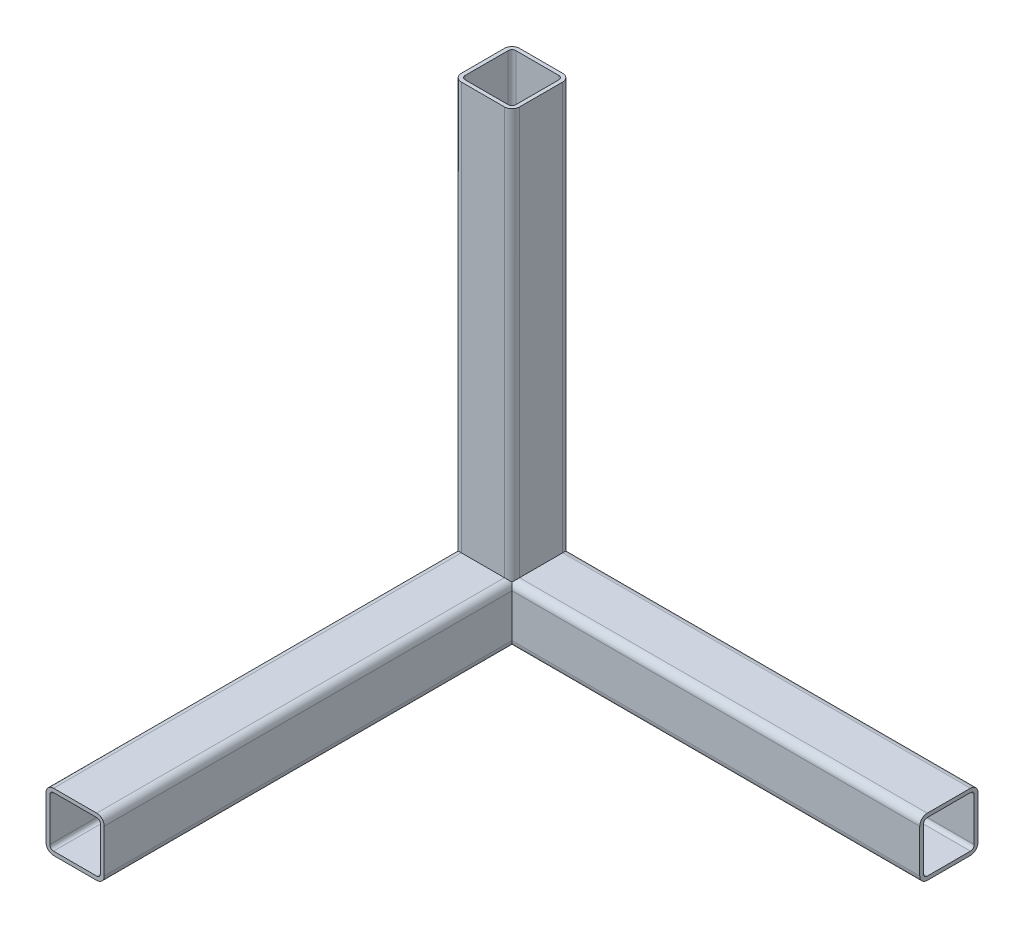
ISO-10303-21;
HEADER;
FILE_DESCRIPTION(('STEP AP214'),'2;1');
FILE_NAME('part.step','',(''),(''),'','','');
FILE_SCHEMA(('AUTOMOTIVE_DESIGN { 1 0 10303 214 1 1 1 1 }'));
ENDSEC;
DATA;
#1=APPLICATION_CONTEXT('core data for automotive mechanical design processes');
#2=APPLICATION_PROTOCOL_DEFINITION('international standard','automotive_design',2000,#1);
#3=PRODUCT_CONTEXT('',#1,'mechanical');
#4=PRODUCT('Part','Part','',(#3));
#5=PRODUCT_RELATED_PRODUCT_CATEGORY('part','',(#4));
#6=PRODUCT_DEFINITION_FORMATION('','',#4);
#7=PRODUCT_DEFINITION_CONTEXT('part definition',#1,'design');
#8=PRODUCT_DEFINITION('design','',#6,#7);
#9=PRODUCT_DEFINITION_SHAPE('','',#8);
#10=(LENGTH_UNIT() NAMED_UNIT(*) SI_UNIT(.MILLI.,.METRE.));
#11=(NAMED_UNIT(*) PLANE_ANGLE_UNIT() SI_UNIT($,.RADIAN.));
#12=(NAMED_UNIT(*) SI_UNIT($,.STERADIAN.) SOLID_ANGLE_UNIT());
#13=UNCERTAINTY_MEASURE_WITH_UNIT(LENGTH_MEASURE(1.E-05),#10,'distance_accuracy_value','');
#14=(GEOMETRIC_REPRESENTATION_CONTEXT(3) GLOBAL_UNCERTAINTY_ASSIGNED_CONTEXT((#13)) GLOBAL_UNIT_ASSIGNED_CONTEXT((#10,
#11,#12)) REPRESENTATION_CONTEXT('',''));
#15=CARTESIAN_POINT('',(0.,0.,0.));
#16=DIRECTION('',(0.,0.,1.));
#17=DIRECTION('',(1.,0.,0.));
#18=AXIS2_PLACEMENT_3D('',#15,#16,#17);
#19=CARTESIAN_POINT('',(-14.8,-1.11022302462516E-13,17.4));
#20=DIRECTION('',(0.,0.,-1.));
#21=DIRECTION('',(-1.,0.,0.));
#22=AXIS2_PLACEMENT_3D('',#19,#20,#21);
#23=PLANE('',#22);
#24=DIRECTION('',(1.,0.,0.));
#25=VECTOR('',#24,1.);
#26=CARTESIAN_POINT('',(-14.8,17.3999999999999,17.4));
#27=LINE('',#26,#25);
#28=CARTESIAN_POINT('',(-14.8,17.3999999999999,17.4));
#29=VERTEX_POINT('',#28);
#30=CARTESIAN_POINT('',(14.8,17.3999999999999,17.4));
#31=VERTEX_POINT('',#30);
#32=EDGE_CURVE('E79',#29,#31,#27,.T.);
#33=ORIENTED_EDGE('',*,*,#32,.F.);
#34=DIRECTION('',(0.,1.,0.));
#35=VECTOR('',#34,1.);
#36=CARTESIAN_POINT('',(-14.8,-1.11022302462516E-13,17.4));
#37=LINE('',#36,#35);
#38=CARTESIAN_POINT('',(-14.8,300.,17.4));
#39=VERTEX_POINT('',#38);
#40=EDGE_CURVE('E286',#29,#39,#37,.T.);
#41=ORIENTED_EDGE('',*,*,#40,.T.);
#42=DIRECTION('',(-1.,0.,0.));
#43=VECTOR('',#42,1.);
#44=CARTESIAN_POINT('',(-14.8,300.,17.4));
#45=LINE('',#44,#43);
#46=CARTESIAN_POINT('',(14.8,300.,17.4));
#47=VERTEX_POINT('',#46);
#48=EDGE_CURVE('E243',#47,#39,#45,.T.);
#49=ORIENTED_EDGE('',*,*,#48,.F.);
#50=DIRECTION('',(0.,1.,0.));
#51=VECTOR('',#50,1.);
#52=CARTESIAN_POINT('',(14.8,0.,17.4));
#53=LINE('',#52,#51);
#54=EDGE_CURVE('E218',#31,#47,#53,.T.);
#55=ORIENTED_EDGE('',*,*,#54,.F.);
#56=EDGE_LOOP('',(#33,#41,#49,#55));
#57=FACE_BOUND('',#56,.T.);
#58=ADVANCED_FACE('F75',(#57),#23,.T.);
#59=CARTESIAN_POINT('',(-14.8,-1.11022302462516E-13,14.8));
#60=DIRECTION('',(0.,1.,0.));
#61=DIRECTION('',(0.,0.,1.));
#62=AXIS2_PLACEMENT_3D('',#59,#60,#61);
#63=CYLINDRICAL_SURFACE('',#62,2.6);
#64=CARTESIAN_POINT('',(-14.8,14.7999999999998,14.8));
#65=DIRECTION('',(0.,0.707106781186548,-0.707106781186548));
#66=DIRECTION('',(0.,0.707106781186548,0.707106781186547));
#67=AXIS2_PLACEMENT_3D('',#64,#65,#66);
#68=ELLIPSE('',#67,3.67695526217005,2.6);
#69=CARTESIAN_POINT('',(-17.4,14.8,14.8));
#70=VERTEX_POINT('',#69);
#71=EDGE_CURVE('E284',#70,#29,#68,.T.);
#72=ORIENTED_EDGE('',*,*,#71,.F.);
#73=DIRECTION('',(0.,1.,0.));
#74=VECTOR('',#73,1.);
#75=CARTESIAN_POINT('',(-17.4,0.,14.8));
#76=LINE('',#75,#74);
#77=CARTESIAN_POINT('',(-17.4,300.,14.8));
#78=VERTEX_POINT('',#77);
#79=EDGE_CURVE('E288',#70,#78,#76,.T.);
#80=ORIENTED_EDGE('',*,*,#79,.T.);
#81=CARTESIAN_POINT('',(-14.8,300.,14.8));
#82=DIRECTION('',(0.,-1.,0.));
#83=DIRECTION('',(0.,0.,-1.));
#84=AXIS2_PLACEMENT_3D('',#81,#82,#83);
#85=CIRCLE('',#84,2.6);
#86=EDGE_CURVE('E240',#39,#78,#85,.T.);
#87=ORIENTED_EDGE('',*,*,#86,.F.);
#88=ORIENTED_EDGE('',*,*,#40,.F.);
#89=EDGE_LOOP('',(#72,#80,#87,#88));
#90=FACE_BOUND('',#89,.T.);
#91=ADVANCED_FACE('F391',(#90),#63,.F.);
#92=CARTESIAN_POINT('',(-17.4,0.,14.8));
#93=DIRECTION('',(1.,0.,0.));
#94=DIRECTION('',(0.,0.,-1.));
#95=AXIS2_PLACEMENT_3D('',#92,#93,#94);
#96=PLANE('',#95);
#97=DIRECTION('',(0.,0.707106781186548,0.707106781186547));
#98=VECTOR('',#97,1.);
#99=CARTESIAN_POINT('',(-17.4,7.39999999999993,7.4));
#100=LINE('',#99,#98);
#101=CARTESIAN_POINT('',(-17.4,-14.8000000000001,-14.8));
#102=VERTEX_POINT('',#101);
#103=EDGE_CURVE('E309',#102,#70,#100,.T.);
#104=ORIENTED_EDGE('',*,*,#103,.F.);
#105=DIRECTION('',(0.,1.,0.));
#106=VECTOR('',#105,1.);
#107=CARTESIAN_POINT('',(-17.4,0.,-14.8));
#108=LINE('',#107,#106);
#109=CARTESIAN_POINT('',(-17.4,300.,-14.8));
#110=VERTEX_POINT('',#109);
#111=EDGE_CURVE('E290',#102,#110,#108,.T.);
#112=ORIENTED_EDGE('',*,*,#111,.T.);
#113=DIRECTION('',(0.,0.,-1.));
#114=VECTOR('',#113,1.);
#115=CARTESIAN_POINT('',(-17.4,300.,14.8));
#116=LINE('',#115,#114);
#117=EDGE_CURVE('E237',#78,#110,#116,.T.);
#118=ORIENTED_EDGE('',*,*,#117,.F.);
#119=ORIENTED_EDGE('',*,*,#79,.F.);
#120=EDGE_LOOP('',(#104,#112,#118,#119));
#121=FACE_BOUND('',#120,.T.);
#122=ADVANCED_FACE('F397',(#121),#96,.T.);
#123=CARTESIAN_POINT('',(-14.8,-1.11022302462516E-13,-14.8));
#124=DIRECTION('',(0.,1.,0.));
#125=DIRECTION('',(0.,0.,1.));
#126=AXIS2_PLACEMENT_3D('',#123,#124,#125);
#127=CYLINDRICAL_SURFACE('',#126,2.6);
#128=CARTESIAN_POINT('',(-14.8,-14.8000000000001,-14.8));
#129=DIRECTION('',(-0.707106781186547,0.707106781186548,0.));
#130=DIRECTION('',(0.707106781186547,0.707106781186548,0.));
#131=AXIS2_PLACEMENT_3D('',#128,#129,#130);
#132=ELLIPSE('',#131,3.67695526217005,2.6);
#133=CARTESIAN_POINT('',(-14.8,-14.8000000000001,-17.4));
#134=VERTEX_POINT('',#133);
#135=CARTESIAN_POINT('',(-16.638477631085,-16.6384776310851,-16.638477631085));
#136=VERTEX_POINT('',#135);
#137=EDGE_CURVE('E93',#134,#136,#132,.T.);
#138=ORIENTED_EDGE('',*,*,#137,.F.);
#139=DIRECTION('',(0.,1.,0.));
#140=VECTOR('',#139,1.);
#141=CARTESIAN_POINT('',(-14.8,0.,-17.4));
#142=LINE('',#141,#140);
#143=CARTESIAN_POINT('',(-14.8,300.,-17.4));
#144=VERTEX_POINT('',#143);
#145=EDGE_CURVE('E292',#134,#144,#142,.T.);
#146=ORIENTED_EDGE('',*,*,#145,.T.);
#147=CARTESIAN_POINT('',(-14.8,300.,-14.8));
#148=DIRECTION('',(0.,-1.,0.));
#149=DIRECTION('',(0.,0.,-1.));
#150=AXIS2_PLACEMENT_3D('',#147,#148,#149);
#151=CIRCLE('',#150,2.6);
#152=EDGE_CURVE('E234',#110,#144,#151,.T.);
#153=ORIENTED_EDGE('',*,*,#152,.F.);
#154=ORIENTED_EDGE('',*,*,#111,.F.);
#155=CARTESIAN_POINT('',(-14.8,-14.8000000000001,-14.8));
#156=DIRECTION('',(0.,0.707106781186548,-0.707106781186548));
#157=DIRECTION('',(0.,0.707106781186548,0.707106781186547));
#158=AXIS2_PLACEMENT_3D('',#155,#156,#157);
#159=ELLIPSE('',#158,3.67695526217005,2.6);
#160=EDGE_CURVE('E311',#136,#102,#159,.T.);
#161=ORIENTED_EDGE('',*,*,#160,.F.);
#162=EDGE_LOOP('',(#138,#146,#153,#154,#161));
#163=FACE_BOUND('',#162,.T.);
#164=ADVANCED_FACE('F405',(#163),#127,.F.);
#165=CARTESIAN_POINT('',(14.8,0.,-17.4));
#166=DIRECTION('',(0.,0.,1.));
#167=DIRECTION('',(1.,0.,0.));
#168=AXIS2_PLACEMENT_3D('',#165,#166,#167);
#169=PLANE('',#168);
#170=DIRECTION('',(-0.707106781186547,-0.707106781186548,0.));
#171=VECTOR('',#170,1.);
#172=CARTESIAN_POINT('',(7.4,7.39999999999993,-17.4));
#173=LINE('',#172,#171);
#174=CARTESIAN_POINT('',(14.8,14.8,-17.4));
#175=VERTEX_POINT('',#174);
#176=EDGE_CURVE('E123',#175,#134,#173,.T.);
#177=ORIENTED_EDGE('',*,*,#176,.F.);
#178=DIRECTION('',(0.,1.,0.));
#179=VECTOR('',#178,1.);
#180=CARTESIAN_POINT('',(14.8,0.,-17.4));
#181=LINE('',#180,#179);
#182=CARTESIAN_POINT('',(14.8,300.,-17.4));
#183=VERTEX_POINT('',#182);
#184=EDGE_CURVE('E294',#175,#183,#181,.T.);
#185=ORIENTED_EDGE('',*,*,#184,.T.);
#186=DIRECTION('',(1.,0.,0.));
#187=VECTOR('',#186,1.);
#188=CARTESIAN_POINT('',(14.8,300.,-17.4));
#189=LINE('',#188,#187);
#190=EDGE_CURVE('E229',#144,#183,#189,.T.);
#191=ORIENTED_EDGE('',*,*,#190,.F.);
#192=ORIENTED_EDGE('',*,*,#145,.F.);
#193=EDGE_LOOP('',(#177,#185,#191,#192));
#194=FACE_BOUND('',#193,.T.);
#195=ADVANCED_FACE('F409',(#194),#169,.T.);
#196=CARTESIAN_POINT('',(14.8,0.,-14.8));
#197=DIRECTION('',(0.,1.,0.));
#198=DIRECTION('',(0.,0.,1.));
#199=AXIS2_PLACEMENT_3D('',#196,#197,#198);
#200=CYLINDRICAL_SURFACE('',#199,2.6);
#201=CARTESIAN_POINT('',(14.8,14.8,-14.8));
#202=DIRECTION('',(-0.707106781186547,0.707106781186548,0.));
#203=DIRECTION('',(0.707106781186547,0.707106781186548,0.));
#204=AXIS2_PLACEMENT_3D('',#201,#202,#203);
#205=ELLIPSE('',#204,3.67695526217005,2.6);
#206=CARTESIAN_POINT('',(17.4,17.3999999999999,-14.8));
#207=VERTEX_POINT('',#206);
#208=EDGE_CURVE('E119',#207,#175,#205,.T.);
#209=ORIENTED_EDGE('',*,*,#208,.F.);
#210=DIRECTION('',(0.,1.,0.));
#211=VECTOR('',#210,1.);
#212=CARTESIAN_POINT('',(17.4,-1.11022302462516E-13,-14.8));
#213=LINE('',#212,#211);
#214=CARTESIAN_POINT('',(17.4,300.,-14.8));
#215=VERTEX_POINT('',#214);
#216=EDGE_CURVE('E213',#207,#215,#213,.T.);
#217=ORIENTED_EDGE('',*,*,#216,.T.);
#218=CARTESIAN_POINT('',(14.8,300.,-14.8));
#219=DIRECTION('',(0.,-1.,0.));
#220=DIRECTION('',(0.,0.,-1.));
#221=AXIS2_PLACEMENT_3D('',#218,#219,#220);
#222=CIRCLE('',#221,2.6);
#223=EDGE_CURVE('E227',#183,#215,#222,.T.);
#224=ORIENTED_EDGE('',*,*,#223,.F.);
#225=ORIENTED_EDGE('',*,*,#184,.F.);
#226=EDGE_LOOP('',(#209,#217,#224,#225));
#227=FACE_BOUND('',#226,.T.);
#228=ADVANCED_FACE('F297',(#227),#200,.F.);
#229=CARTESIAN_POINT('',(17.4,-1.11022302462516E-13,-14.8));
#230=DIRECTION('',(-1.,0.,0.));
#231=DIRECTION('',(0.,0.,1.));
#232=AXIS2_PLACEMENT_3D('',#229,#230,#231);
#233=PLANE('',#232);
#234=DIRECTION('',(0.,0.,-1.));
#235=VECTOR('',#234,1.);
#236=CARTESIAN_POINT('',(17.4,17.3999999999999,-14.8));
#237=LINE('',#236,#235);
#238=CARTESIAN_POINT('',(17.4,17.3999999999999,14.8));
#239=VERTEX_POINT('',#238);
#240=EDGE_CURVE('E85',#239,#207,#237,.T.);
#241=ORIENTED_EDGE('',*,*,#240,.F.);
#242=DIRECTION('',(0.,1.,0.));
#243=VECTOR('',#242,1.);
#244=CARTESIAN_POINT('',(17.4,-1.11022302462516E-13,14.8));
#245=LINE('',#244,#243);
#246=CARTESIAN_POINT('',(17.4,300.,14.8));
#247=VERTEX_POINT('',#246);
#248=EDGE_CURVE('E203',#239,#247,#245,.T.);
#249=ORIENTED_EDGE('',*,*,#248,.T.);
#250=DIRECTION('',(0.,0.,1.));
#251=VECTOR('',#250,1.);
#252=CARTESIAN_POINT('',(17.4,300.,-14.8));
#253=LINE('',#252,#251);
#254=EDGE_CURVE('E208',#215,#247,#253,.T.);
#255=ORIENTED_EDGE('',*,*,#254,.F.);
#256=ORIENTED_EDGE('',*,*,#216,.F.);
#257=EDGE_LOOP('',(#241,#249,#255,#256));
#258=FACE_BOUND('',#257,.T.);
#259=ADVANCED_FACE('F205',(#258),#233,.T.);
#260=CARTESIAN_POINT('',(14.8,0.,14.8));
#261=DIRECTION('',(0.,1.,0.));
#262=DIRECTION('',(0.,0.,1.));
#263=AXIS2_PLACEMENT_3D('',#260,#261,#262);
#264=CYLINDRICAL_SURFACE('',#263,2.60000000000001);
#265=CARTESIAN_POINT('',(14.8,14.8,14.8));
#266=DIRECTION('',(-0.707106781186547,0.707106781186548,0.));
#267=DIRECTION('',(0.707106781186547,0.707106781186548,0.));
#268=AXIS2_PLACEMENT_3D('',#265,#266,#267);
#269=ELLIPSE('',#268,3.67695526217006,2.60000000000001);
#270=CARTESIAN_POINT('',(16.638477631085,16.6384776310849,16.638477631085));
#271=VERTEX_POINT('',#270);
#272=EDGE_CURVE('E13',#271,#239,#269,.T.);
#273=ORIENTED_EDGE('',*,*,#272,.F.);
#274=CARTESIAN_POINT('',(14.8,14.8,14.8));
#275=DIRECTION('',(0.,0.707106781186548,-0.707106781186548));
#276=DIRECTION('',(0.,0.707106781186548,0.707106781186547));
#277=AXIS2_PLACEMENT_3D('',#274,#275,#276);
#278=ELLIPSE('',#277,3.67695526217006,2.60000000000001);
#279=EDGE_CURVE('E313',#31,#271,#278,.T.);
#280=ORIENTED_EDGE('',*,*,#279,.F.);
#281=ORIENTED_EDGE('',*,*,#54,.T.);
#282=CARTESIAN_POINT('',(14.8,300.,14.8));
#283=DIRECTION('',(0.,-1.,0.));
#284=DIRECTION('',(0.,0.,-1.));
#285=AXIS2_PLACEMENT_3D('',#282,#283,#284);
#286=CIRCLE('',#285,2.60000000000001);
#287=EDGE_CURVE('E215',#247,#47,#286,.T.);
#288=ORIENTED_EDGE('',*,*,#287,.F.);
#289=ORIENTED_EDGE('',*,*,#248,.F.);
#290=EDGE_LOOP('',(#273,#280,#281,#288,#289));
#291=FACE_BOUND('',#290,.T.);
#292=ADVANCED_FACE('F77',(#291),#264,.F.);
#293=CARTESIAN_POINT('',(14.8,300.,-14.8));
#294=DIRECTION('',(0.,-1.,0.));
#295=DIRECTION('',(0.,0.,-1.));
#296=AXIS2_PLACEMENT_3D('',#293,#294,#295);
#297=PLANE('',#296);
#298=ORIENTED_EDGE('',*,*,#287,.T.);
#299=ORIENTED_EDGE('',*,*,#48,.T.);
#300=ORIENTED_EDGE('',*,*,#86,.T.);
#301=ORIENTED_EDGE('',*,*,#117,.T.);
#302=ORIENTED_EDGE('',*,*,#152,.T.);
#303=ORIENTED_EDGE('',*,*,#190,.T.);
#304=ORIENTED_EDGE('',*,*,#223,.T.);
#305=ORIENTED_EDGE('',*,*,#254,.T.);
#306=EDGE_LOOP('',(#298,#299,#300,#301,#302,#303,#304,#305));
#307=FACE_BOUND('',#306,.T.);
#308=CARTESIAN_POINT('',(14.8,300.,-14.8));
#309=DIRECTION('',(0.,-1.,0.));
#310=DIRECTION('',(0.,0.,-1.));
#311=AXIS2_PLACEMENT_3D('',#308,#309,#310);
#312=CIRCLE('',#311,5.2);
#313=CARTESIAN_POINT('',(14.8,300.,-20.));
#314=VERTEX_POINT('',#313);
#315=CARTESIAN_POINT('',(20.,300.,-14.8));
#316=VERTEX_POINT('',#315);
#317=EDGE_CURVE('E245',#314,#316,#312,.T.);
#318=ORIENTED_EDGE('',*,*,#317,.F.);
#319=DIRECTION('',(1.,0.,0.));
#320=VECTOR('',#319,1.);
#321=CARTESIAN_POINT('',(14.8,300.,-20.));
#322=LINE('',#321,#320);
#323=CARTESIAN_POINT('',(-14.8,300.,-20.));
#324=VERTEX_POINT('',#323);
#325=EDGE_CURVE('E266',#324,#314,#322,.T.);
#326=ORIENTED_EDGE('',*,*,#325,.F.);
#327=CARTESIAN_POINT('',(-14.8,300.,-14.8));
#328=DIRECTION('',(0.,-1.,0.));
#329=DIRECTION('',(0.,0.,-1.));
#330=AXIS2_PLACEMENT_3D('',#327,#328,#329);
#331=CIRCLE('',#330,5.2);
#332=CARTESIAN_POINT('',(-20.,300.,-14.8));
#333=VERTEX_POINT('',#332);
#334=EDGE_CURVE('E263',#333,#324,#331,.T.);
#335=ORIENTED_EDGE('',*,*,#334,.F.);
#336=DIRECTION('',(0.,0.,-1.));
#337=VECTOR('',#336,1.);
#338=CARTESIAN_POINT('',(-20.,300.,14.8));
#339=LINE('',#338,#337);
#340=CARTESIAN_POINT('',(-20.,300.,14.8));
#341=VERTEX_POINT('',#340);
#342=EDGE_CURVE('E260',#341,#333,#339,.T.);
#343=ORIENTED_EDGE('',*,*,#342,.F.);
#344=CARTESIAN_POINT('',(-14.8,300.,14.8));
#345=DIRECTION('',(0.,-1.,0.));
#346=DIRECTION('',(0.,0.,-1.));
#347=AXIS2_PLACEMENT_3D('',#344,#345,#346);
#348=CIRCLE('',#347,5.2);
#349=CARTESIAN_POINT('',(-14.8,300.,20.));
#350=VERTEX_POINT('',#349);
#351=EDGE_CURVE('E257',#350,#341,#348,.T.);
#352=ORIENTED_EDGE('',*,*,#351,.F.);
#353=DIRECTION('',(-1.,0.,0.));
#354=VECTOR('',#353,1.);
#355=CARTESIAN_POINT('',(-14.8,300.,20.));
#356=LINE('',#355,#354);
#357=CARTESIAN_POINT('',(14.8,300.,20.));
#358=VERTEX_POINT('',#357);
#359=EDGE_CURVE('E254',#358,#350,#356,.T.);
#360=ORIENTED_EDGE('',*,*,#359,.F.);
#361=CARTESIAN_POINT('',(14.8,300.,14.8));
#362=DIRECTION('',(0.,-1.,0.));
#363=DIRECTION('',(0.,0.,-1.));
#364=AXIS2_PLACEMENT_3D('',#361,#362,#363);
#365=CIRCLE('',#364,5.2);
#366=CARTESIAN_POINT('',(20.,300.,14.8));
#367=VERTEX_POINT('',#366);
#368=EDGE_CURVE('E251',#367,#358,#365,.T.);
#369=ORIENTED_EDGE('',*,*,#368,.F.);
#370=DIRECTION('',(0.,0.,1.));
#371=VECTOR('',#370,1.);
#372=CARTESIAN_POINT('',(20.,300.,-14.8));
#373=LINE('',#372,#371);
#374=EDGE_CURVE('E248',#316,#367,#373,.T.);
#375=ORIENTED_EDGE('',*,*,#374,.F.);
#376=EDGE_LOOP('',(#318,#326,#335,#343,#352,#360,#369,#375));
#377=FACE_BOUND('',#376,.T.);
#378=ADVANCED_FACE('F223',(#307,#377),#297,.F.);
#379=CARTESIAN_POINT('',(14.8,0.,-20.));
#380=DIRECTION('',(0.,0.,1.));
#381=DIRECTION('',(1.,0.,0.));
#382=AXIS2_PLACEMENT_3D('',#379,#380,#381);
#383=PLANE('',#382);
#384=DIRECTION('',(0.,1.,0.));
#385=VECTOR('',#384,1.);
#386=CARTESIAN_POINT('',(14.8,0.,-20.));
#387=LINE('',#386,#385);
#388=CARTESIAN_POINT('',(14.8,14.8,-20.));
#389=VERTEX_POINT('',#388);
#390=EDGE_CURVE('E212',#389,#314,#387,.T.);
#391=ORIENTED_EDGE('',*,*,#390,.F.);
#392=DIRECTION('',(-0.707106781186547,-0.707106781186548,0.));
#393=VECTOR('',#392,1.);
#394=CARTESIAN_POINT('',(7.4,7.39999999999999,-20.));
#395=LINE('',#394,#393);
#396=CARTESIAN_POINT('',(-14.8,-14.8000000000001,-20.));
#397=VERTEX_POINT('',#396);
#398=EDGE_CURVE('E344',#389,#397,#395,.T.);
#399=ORIENTED_EDGE('',*,*,#398,.T.);
#400=DIRECTION('',(0.,1.,0.));
#401=VECTOR('',#400,1.);
#402=CARTESIAN_POINT('',(-14.8,0.,-20.));
#403=LINE('',#402,#401);
#404=EDGE_CURVE('E270',#397,#324,#403,.T.);
#405=ORIENTED_EDGE('',*,*,#404,.T.);
#406=ORIENTED_EDGE('',*,*,#325,.T.);
#407=EDGE_LOOP('',(#391,#399,#405,#406));
#408=FACE_BOUND('',#407,.T.);
#409=ADVANCED_FACE('F365',(#408),#383,.F.);
#410=CARTESIAN_POINT('',(-14.8,-1.11022302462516E-13,-14.8));
#411=DIRECTION('',(0.,1.,0.));
#412=DIRECTION('',(0.,0.,1.));
#413=AXIS2_PLACEMENT_3D('',#410,#411,#412);
#414=CYLINDRICAL_SURFACE('',#413,5.2);
#415=ORIENTED_EDGE('',*,*,#404,.F.);
#416=CARTESIAN_POINT('',(-14.8,-14.8000000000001,-14.8));
#417=DIRECTION('',(-0.707106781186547,0.707106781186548,0.));
#418=DIRECTION('',(0.707106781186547,0.707106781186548,0.));
#419=AXIS2_PLACEMENT_3D('',#416,#417,#418);
#420=ELLIPSE('',#419,7.3539105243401,5.2);
#421=CARTESIAN_POINT('',(-18.4769552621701,-18.4769552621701,-18.4769552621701));
#422=VERTEX_POINT('',#421);
#423=EDGE_CURVE('E306',#397,#422,#420,.T.);
#424=ORIENTED_EDGE('',*,*,#423,.T.);
#425=CARTESIAN_POINT('',(-14.8,-14.8000000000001,-14.8));
#426=DIRECTION('',(0.,0.707106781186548,-0.707106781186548));
#427=DIRECTION('',(0.,0.707106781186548,0.707106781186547));
#428=AXIS2_PLACEMENT_3D('',#425,#426,#427);
#429=ELLIPSE('',#428,7.3539105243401,5.2);
#430=CARTESIAN_POINT('',(-20.,-14.8000000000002,-14.8));
#431=VERTEX_POINT('',#430);
#432=EDGE_CURVE('E316',#422,#431,#429,.T.);
#433=ORIENTED_EDGE('',*,*,#432,.T.);
#434=DIRECTION('',(0.,1.,0.));
#435=VECTOR('',#434,1.);
#436=CARTESIAN_POINT('',(-20.,-1.11022302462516E-13,-14.8));
#437=LINE('',#436,#435);
#438=EDGE_CURVE('E272',#431,#333,#437,.T.);
#439=ORIENTED_EDGE('',*,*,#438,.T.);
#440=ORIENTED_EDGE('',*,*,#334,.T.);
#441=EDGE_LOOP('',(#415,#424,#433,#439,#440));
#442=FACE_BOUND('',#441,.T.);
#443=ADVANCED_FACE('F350',(#442),#414,.T.);
#444=CARTESIAN_POINT('',(-20.,0.,14.8));
#445=DIRECTION('',(1.,0.,0.));
#446=DIRECTION('',(0.,0.,-1.));
#447=AXIS2_PLACEMENT_3D('',#444,#445,#446);
#448=PLANE('',#447);
#449=ORIENTED_EDGE('',*,*,#438,.F.);
#450=DIRECTION('',(0.,0.707106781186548,0.707106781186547));
#451=VECTOR('',#450,1.);
#452=CARTESIAN_POINT('',(-20.,7.39999999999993,7.4));
#453=LINE('',#452,#451);
#454=CARTESIAN_POINT('',(-20.,14.7999999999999,14.8));
#455=VERTEX_POINT('',#454);
#456=EDGE_CURVE('E319',#431,#455,#453,.T.);
#457=ORIENTED_EDGE('',*,*,#456,.T.);
#458=DIRECTION('',(0.,1.,0.));
#459=VECTOR('',#458,1.);
#460=CARTESIAN_POINT('',(-20.,0.,14.8));
#461=LINE('',#460,#459);
#462=EDGE_CURVE('E274',#455,#341,#461,.T.);
#463=ORIENTED_EDGE('',*,*,#462,.T.);
#464=ORIENTED_EDGE('',*,*,#342,.T.);
#465=EDGE_LOOP('',(#449,#457,#463,#464));
#466=FACE_BOUND('',#465,.T.);
#467=ADVANCED_FACE('F358',(#466),#448,.F.);
#468=CARTESIAN_POINT('',(-14.8,-1.11022302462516E-13,14.8));
#469=DIRECTION('',(0.,1.,0.));
#470=DIRECTION('',(0.,0.,1.));
#471=AXIS2_PLACEMENT_3D('',#468,#469,#470);
#472=CYLINDRICAL_SURFACE('',#471,5.2);
#473=ORIENTED_EDGE('',*,*,#462,.F.);
#474=CARTESIAN_POINT('',(-14.8,14.7999999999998,14.8));
#475=DIRECTION('',(0.,0.707106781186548,-0.707106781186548));
#476=DIRECTION('',(0.,0.707106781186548,0.707106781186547));
#477=AXIS2_PLACEMENT_3D('',#474,#475,#476);
#478=ELLIPSE('',#477,7.3539105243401,5.2);
#479=CARTESIAN_POINT('',(-14.8,19.9999999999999,20.));
#480=VERTEX_POINT('',#479);
#481=EDGE_CURVE('E322',#455,#480,#478,.T.);
#482=ORIENTED_EDGE('',*,*,#481,.T.);
#483=DIRECTION('',(0.,1.,0.));
#484=VECTOR('',#483,1.);
#485=CARTESIAN_POINT('',(-14.8,0.,20.));
#486=LINE('',#485,#484);
#487=EDGE_CURVE('E276',#480,#350,#486,.T.);
#488=ORIENTED_EDGE('',*,*,#487,.T.);
#489=ORIENTED_EDGE('',*,*,#351,.T.);
#490=EDGE_LOOP('',(#473,#482,#488,#489));
#491=FACE_BOUND('',#490,.T.);
#492=ADVANCED_FACE('F381',(#491),#472,.T.);
#493=CARTESIAN_POINT('',(-14.8,0.,20.));
#494=DIRECTION('',(0.,0.,-1.));
#495=DIRECTION('',(-1.,0.,0.));
#496=AXIS2_PLACEMENT_3D('',#493,#494,#495);
#497=PLANE('',#496);
#498=ORIENTED_EDGE('',*,*,#487,.F.);
#499=DIRECTION('',(1.,0.,0.));
#500=VECTOR('',#499,1.);
#501=CARTESIAN_POINT('',(-14.8,19.9999999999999,20.));
#502=LINE('',#501,#500);
#503=CARTESIAN_POINT('',(14.8,20.,20.));
#504=VERTEX_POINT('',#503);
#505=EDGE_CURVE('E325',#480,#504,#502,.T.);
#506=ORIENTED_EDGE('',*,*,#505,.T.);
#507=DIRECTION('',(0.,1.,0.));
#508=VECTOR('',#507,1.);
#509=CARTESIAN_POINT('',(14.8,0.,20.));
#510=LINE('',#509,#508);
#511=EDGE_CURVE('E278',#504,#358,#510,.T.);
#512=ORIENTED_EDGE('',*,*,#511,.T.);
#513=ORIENTED_EDGE('',*,*,#359,.T.);
#514=EDGE_LOOP('',(#498,#506,#512,#513));
#515=FACE_BOUND('',#514,.T.);
#516=ADVANCED_FACE('F379',(#515),#497,.F.);
#517=CARTESIAN_POINT('',(14.8,0.,14.8));
#518=DIRECTION('',(0.,1.,0.));
#519=DIRECTION('',(0.,0.,1.));
#520=AXIS2_PLACEMENT_3D('',#517,#518,#519);
#521=CYLINDRICAL_SURFACE('',#520,5.2);
#522=CARTESIAN_POINT('',(14.8,14.8,14.8));
#523=DIRECTION('',(0.,0.707106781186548,-0.707106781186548));
#524=DIRECTION('',(0.,0.707106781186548,0.707106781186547));
#525=AXIS2_PLACEMENT_3D('',#522,#523,#524);
#526=ELLIPSE('',#525,7.3539105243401,5.2);
#527=CARTESIAN_POINT('',(18.4769552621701,18.4769552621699,18.4769552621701));
#528=VERTEX_POINT('',#527);
#529=EDGE_CURVE('E327',#504,#528,#526,.T.);
#530=ORIENTED_EDGE('',*,*,#529,.T.);
#531=CARTESIAN_POINT('',(14.8,14.8,14.8));
#532=DIRECTION('',(-0.707106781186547,0.707106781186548,0.));
#533=DIRECTION('',(0.707106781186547,0.707106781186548,0.));
#534=AXIS2_PLACEMENT_3D('',#531,#532,#533);
#535=ELLIPSE('',#534,7.3539105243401,5.2);
#536=CARTESIAN_POINT('',(20.,20.,14.8));
#537=VERTEX_POINT('',#536);
#538=EDGE_CURVE('E335',#528,#537,#535,.T.);
#539=ORIENTED_EDGE('',*,*,#538,.T.);
#540=DIRECTION('',(0.,1.,0.));
#541=VECTOR('',#540,1.);
#542=CARTESIAN_POINT('',(20.,0.,14.8));
#543=LINE('',#542,#541);
#544=EDGE_CURVE('E280',#537,#367,#543,.T.);
#545=ORIENTED_EDGE('',*,*,#544,.T.);
#546=ORIENTED_EDGE('',*,*,#368,.T.);
#547=ORIENTED_EDGE('',*,*,#511,.F.);
#548=EDGE_LOOP('',(#530,#539,#545,#546,#547));
#549=FACE_BOUND('',#548,.T.);
#550=ADVANCED_FACE('F374',(#549),#521,.T.);
#551=CARTESIAN_POINT('',(20.,-1.11022302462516E-13,-14.8));
#552=DIRECTION('',(-1.,0.,0.));
#553=DIRECTION('',(0.,0.,1.));
#554=AXIS2_PLACEMENT_3D('',#551,#552,#553);
#555=PLANE('',#554);
#556=ORIENTED_EDGE('',*,*,#544,.F.);
#557=DIRECTION('',(0.,0.,-1.));
#558=VECTOR('',#557,1.);
#559=CARTESIAN_POINT('',(20.,20.,-14.8));
#560=LINE('',#559,#558);
#561=CARTESIAN_POINT('',(20.,20.,-14.8));
#562=VERTEX_POINT('',#561);
#563=EDGE_CURVE('E337',#537,#562,#560,.T.);
#564=ORIENTED_EDGE('',*,*,#563,.T.);
#565=DIRECTION('',(0.,1.,0.));
#566=VECTOR('',#565,1.);
#567=CARTESIAN_POINT('',(20.,-1.11022302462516E-13,-14.8));
#568=LINE('',#567,#566);
#569=EDGE_CURVE('E282',#562,#316,#568,.T.);
#570=ORIENTED_EDGE('',*,*,#569,.T.);
#571=ORIENTED_EDGE('',*,*,#374,.T.);
#572=EDGE_LOOP('',(#556,#564,#570,#571));
#573=FACE_BOUND('',#572,.T.);
#574=ADVANCED_FACE('F372',(#573),#555,.F.);
#575=CARTESIAN_POINT('',(14.8,0.,-14.8));
#576=DIRECTION('',(0.,1.,0.));
#577=DIRECTION('',(0.,0.,1.));
#578=AXIS2_PLACEMENT_3D('',#575,#576,#577);
#579=CYLINDRICAL_SURFACE('',#578,5.2);
#580=ORIENTED_EDGE('',*,*,#569,.F.);
#581=CARTESIAN_POINT('',(14.8,14.8,-14.8));
#582=DIRECTION('',(-0.707106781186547,0.707106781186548,0.));
#583=DIRECTION('',(0.707106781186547,0.707106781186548,0.));
#584=AXIS2_PLACEMENT_3D('',#581,#582,#583);
#585=ELLIPSE('',#584,7.3539105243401,5.2);
#586=EDGE_CURVE('E340',#562,#389,#585,.T.);
#587=ORIENTED_EDGE('',*,*,#586,.T.);
#588=ORIENTED_EDGE('',*,*,#390,.T.);
#589=ORIENTED_EDGE('',*,*,#317,.T.);
#590=EDGE_LOOP('',(#580,#587,#588,#589));
#591=FACE_BOUND('',#590,.T.);
#592=ADVANCED_FACE('F369',(#591),#579,.T.);
#593=CARTESIAN_POINT('',(0.,0.,0.));
#594=DIRECTION('',(0.,0.707106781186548,-0.707106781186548));
#595=DIRECTION('',(0.,0.707106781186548,0.707106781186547));
#596=AXIS2_PLACEMENT_3D('',#593,#594,#595);
#597=PLANE('',#596);
#598=ORIENTED_EDGE('',*,*,#505,.F.);
#599=ORIENTED_EDGE('',*,*,#481,.F.);
#600=ORIENTED_EDGE('',*,*,#456,.F.);
#601=ORIENTED_EDGE('',*,*,#432,.F.);
#602=DIRECTION('',(0.577350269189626,0.577350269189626,0.577350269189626));
#603=VECTOR('',#602,1.);
#604=CARTESIAN_POINT('',(0.,0.,0.));
#605=LINE('',#604,#603);
#606=EDGE_CURVE('E303',#422,#136,#605,.T.);
#607=ORIENTED_EDGE('',*,*,#606,.T.);
#608=ORIENTED_EDGE('',*,*,#160,.T.);
#609=ORIENTED_EDGE('',*,*,#103,.T.);
#610=ORIENTED_EDGE('',*,*,#71,.T.);
#611=ORIENTED_EDGE('',*,*,#32,.T.);
#612=ORIENTED_EDGE('',*,*,#279,.T.);
#613=EDGE_CURVE('E307',#271,#528,#605,.T.);
#614=ORIENTED_EDGE('',*,*,#613,.T.);
#615=ORIENTED_EDGE('',*,*,#529,.F.);
#616=EDGE_LOOP('',(#598,#599,#600,#601,#607,#608,#609,#610,#611,#612,#614,#615));
#617=FACE_BOUND('',#616,.T.);
#618=ADVANCED_FACE('F354',(#617),#597,.F.);
#619=CARTESIAN_POINT('',(0.,0.,0.));
#620=DIRECTION('',(-0.707106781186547,0.707106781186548,0.));
#621=DIRECTION('',(-0.707106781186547,-0.707106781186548,0.));
#622=AXIS2_PLACEMENT_3D('',#619,#620,#621);
#623=PLANE('',#622);
#624=ORIENTED_EDGE('',*,*,#137,.T.);
#625=ORIENTED_EDGE('',*,*,#606,.F.);
#626=ORIENTED_EDGE('',*,*,#423,.F.);
#627=ORIENTED_EDGE('',*,*,#398,.F.);
#628=ORIENTED_EDGE('',*,*,#586,.F.);
#629=ORIENTED_EDGE('',*,*,#563,.F.);
#630=ORIENTED_EDGE('',*,*,#538,.F.);
#631=ORIENTED_EDGE('',*,*,#613,.F.);
#632=ORIENTED_EDGE('',*,*,#272,.T.);
#633=ORIENTED_EDGE('',*,*,#240,.T.);
#634=ORIENTED_EDGE('',*,*,#208,.T.);
#635=ORIENTED_EDGE('',*,*,#176,.T.);
#636=EDGE_LOOP('',(#624,#625,#626,#627,#628,#629,#630,#631,#632,#633,#634,#635));
#637=FACE_BOUND('',#636,.T.);
#638=ADVANCED_FACE('F352',(#637),#623,.F.);
#639=CLOSED_SHELL('',(#58,#91,#122,#164,#195,#228,#259,#292,#378,#409,#443,#467,#492,#516,#550,
#574,#592,#618,#638));
#640=MANIFOLD_SOLID_BREP('B2',#639);
#641=CARTESIAN_POINT('',(300.,-14.8,-14.8));
#642=DIRECTION('',(-1.,0.,0.));
#643=DIRECTION('',(0.,0.,1.));
#644=AXIS2_PLACEMENT_3D('',#641,#642,#643);
#645=CYLINDRICAL_SURFACE('',#644,2.6);
#646=DIRECTION('',(-1.,0.,0.));
#647=VECTOR('',#646,1.);
#648=CARTESIAN_POINT('',(300.,-14.8,-17.4));
#649=LINE('',#648,#647);
#650=CARTESIAN_POINT('',(300.,-14.8,-17.4));
#651=VERTEX_POINT('',#650);
#652=CARTESIAN_POINT('',(-14.8,-14.8,-17.4));
#653=VERTEX_POINT('',#652);
#654=EDGE_CURVE('E621',#651,#653,#649,.T.);
#655=ORIENTED_EDGE('',*,*,#654,.T.);
#656=CARTESIAN_POINT('',(-14.8,-14.8,-14.8));
#657=DIRECTION('',(-0.707106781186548,0.707106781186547,0.));
#658=DIRECTION('',(-0.707106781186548,-0.707106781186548,0.));
#659=AXIS2_PLACEMENT_3D('',#656,#657,#658);
#660=ELLIPSE('',#659,3.67695526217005,2.6);
#661=CARTESIAN_POINT('',(-16.638477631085,-16.638477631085,-16.638477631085));
#662=VERTEX_POINT('',#661);
#663=EDGE_CURVE('E808',#653,#662,#660,.T.);
#664=ORIENTED_EDGE('',*,*,#663,.T.);
#665=CARTESIAN_POINT('',(-14.8,-14.8,-14.8));
#666=DIRECTION('',(0.707106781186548,0.,-0.707106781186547));
#667=DIRECTION('',(-0.707106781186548,0.,-0.707106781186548));
#668=AXIS2_PLACEMENT_3D('',#665,#666,#667);
#669=ELLIPSE('',#668,3.67695526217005,2.6);
#670=CARTESIAN_POINT('',(-14.8,-17.4,-14.8));
#671=VERTEX_POINT('',#670);
#672=EDGE_CURVE('E781',#671,#662,#669,.T.);
#673=ORIENTED_EDGE('',*,*,#672,.F.);
#674=DIRECTION('',(-1.,0.,0.));
#675=VECTOR('',#674,1.);
#676=CARTESIAN_POINT('',(300.,-17.4,-14.8));
#677=LINE('',#676,#675);
#678=CARTESIAN_POINT('',(300.,-17.4,-14.8));
#679=VERTEX_POINT('',#678);
#680=EDGE_CURVE('E880',#679,#671,#677,.T.);
#681=ORIENTED_EDGE('',*,*,#680,.F.);
#682=CARTESIAN_POINT('',(300.,-14.8,-14.8));
#683=DIRECTION('',(1.,0.,0.));
#684=DIRECTION('',(0.,0.,-1.));
#685=AXIS2_PLACEMENT_3D('',#682,#683,#684);
#686=CIRCLE('',#685,2.6);
#687=EDGE_CURVE('E809',#679,#651,#686,.T.);
#688=ORIENTED_EDGE('',*,*,#687,.T.);
#689=EDGE_LOOP('',(#655,#664,#673,#681,#688));
#690=FACE_BOUND('',#689,.T.);
#691=ADVANCED_FACE('F617',(#690),#645,.F.);
#692=CARTESIAN_POINT('',(300.,14.8,-17.4));
#693=DIRECTION('',(0.,0.,1.));
#694=DIRECTION('',(1.,0.,0.));
#695=AXIS2_PLACEMENT_3D('',#692,#693,#694);
#696=PLANE('',#695);
#697=DIRECTION('',(-1.,0.,0.));
#698=VECTOR('',#697,1.);
#699=CARTESIAN_POINT('',(300.,14.8,-17.4));
#700=LINE('',#699,#698);
#701=CARTESIAN_POINT('',(300.,14.8,-17.4));
#702=VERTEX_POINT('',#701);
#703=CARTESIAN_POINT('',(14.8,14.8,-17.4));
#704=VERTEX_POINT('',#703);
#705=EDGE_CURVE('E807',#702,#704,#700,.T.);
#706=ORIENTED_EDGE('',*,*,#705,.T.);
#707=DIRECTION('',(-0.707106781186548,-0.707106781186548,0.));
#708=VECTOR('',#707,1.);
#709=CARTESIAN_POINT('',(157.4,157.4,-17.4));
#710=LINE('',#709,#708);
#711=EDGE_CURVE('E803',#704,#653,#710,.T.);
#712=ORIENTED_EDGE('',*,*,#711,.T.);
#713=ORIENTED_EDGE('',*,*,#654,.F.);
#714=DIRECTION('',(0.,1.,0.));
#715=VECTOR('',#714,1.);
#716=CARTESIAN_POINT('',(300.,14.8,-17.4));
#717=LINE('',#716,#715);
#718=EDGE_CURVE('E806',#651,#702,#717,.T.);
#719=ORIENTED_EDGE('',*,*,#718,.T.);
#720=EDGE_LOOP('',(#706,#712,#713,#719));
#721=FACE_BOUND('',#720,.T.);
#722=ADVANCED_FACE('F926',(#721),#696,.T.);
#723=CARTESIAN_POINT('',(300.,14.8,-14.8));
#724=DIRECTION('',(-1.,0.,0.));
#725=DIRECTION('',(0.,0.,1.));
#726=AXIS2_PLACEMENT_3D('',#723,#724,#725);
#727=CYLINDRICAL_SURFACE('',#726,2.6);
#728=DIRECTION('',(-1.,0.,0.));
#729=VECTOR('',#728,1.);
#730=CARTESIAN_POINT('',(300.,17.4,-14.8));
#731=LINE('',#730,#729);
#732=CARTESIAN_POINT('',(300.,17.4,-14.8));
#733=VERTEX_POINT('',#732);
#734=CARTESIAN_POINT('',(17.4,17.4,-14.8));
#735=VERTEX_POINT('',#734);
#736=EDGE_CURVE('E802',#733,#735,#731,.T.);
#737=ORIENTED_EDGE('',*,*,#736,.T.);
#738=CARTESIAN_POINT('',(14.8,14.8,-14.8));
#739=DIRECTION('',(-0.707106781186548,0.707106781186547,0.));
#740=DIRECTION('',(-0.707106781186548,-0.707106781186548,0.));
#741=AXIS2_PLACEMENT_3D('',#738,#739,#740);
#742=ELLIPSE('',#741,3.67695526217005,2.6);
#743=EDGE_CURVE('E798',#735,#704,#742,.T.);
#744=ORIENTED_EDGE('',*,*,#743,.T.);
#745=ORIENTED_EDGE('',*,*,#705,.F.);
#746=CARTESIAN_POINT('',(300.,14.8,-14.8));
#747=DIRECTION('',(1.,0.,0.));
#748=DIRECTION('',(0.,0.,-1.));
#749=AXIS2_PLACEMENT_3D('',#746,#747,#748);
#750=CIRCLE('',#749,2.6);
#751=EDGE_CURVE('E801',#702,#733,#750,.T.);
#752=ORIENTED_EDGE('',*,*,#751,.T.);
#753=EDGE_LOOP('',(#737,#744,#745,#752));
#754=FACE_BOUND('',#753,.T.);
#755=ADVANCED_FACE('F921',(#754),#727,.F.);
#756=CARTESIAN_POINT('',(300.,17.4,-14.8));
#757=DIRECTION('',(0.,-1.,0.));
#758=DIRECTION('',(0.,0.,-1.));
#759=AXIS2_PLACEMENT_3D('',#756,#757,#758);
#760=PLANE('',#759);
#761=DIRECTION('',(-1.,0.,0.));
#762=VECTOR('',#761,1.);
#763=CARTESIAN_POINT('',(300.,17.4,14.8));
#764=LINE('',#763,#762);
#765=CARTESIAN_POINT('',(300.,17.4,14.8));
#766=VERTEX_POINT('',#765);
#767=CARTESIAN_POINT('',(17.4,17.4,14.8));
#768=VERTEX_POINT('',#767);
#769=EDGE_CURVE('E709',#766,#768,#764,.T.);
#770=ORIENTED_EDGE('',*,*,#769,.T.);
#771=DIRECTION('',(0.,0.,-1.));
#772=VECTOR('',#771,1.);
#773=CARTESIAN_POINT('',(17.4,17.4,-14.8000000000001));
#774=LINE('',#773,#772);
#775=EDGE_CURVE('E795',#768,#735,#774,.T.);
#776=ORIENTED_EDGE('',*,*,#775,.T.);
#777=ORIENTED_EDGE('',*,*,#736,.F.);
#778=DIRECTION('',(0.,0.,1.));
#779=VECTOR('',#778,1.);
#780=CARTESIAN_POINT('',(300.,17.4,-14.8));
#781=LINE('',#780,#779);
#782=EDGE_CURVE('E794',#733,#766,#781,.T.);
#783=ORIENTED_EDGE('',*,*,#782,.T.);
#784=EDGE_LOOP('',(#770,#776,#777,#783));
#785=FACE_BOUND('',#784,.T.);
#786=ADVANCED_FACE('F924',(#785),#760,.T.);
#787=CARTESIAN_POINT('',(300.,14.8,14.8));
#788=DIRECTION('',(-1.,0.,0.));
#789=DIRECTION('',(0.,0.,1.));
#790=AXIS2_PLACEMENT_3D('',#787,#788,#789);
#791=CYLINDRICAL_SURFACE('',#790,2.60000000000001);
#792=CARTESIAN_POINT('',(14.8,14.8,14.8));
#793=DIRECTION('',(0.707106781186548,0.,-0.707106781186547));
#794=DIRECTION('',(-0.707106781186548,0.,-0.707106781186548));
#795=AXIS2_PLACEMENT_3D('',#792,#793,#794);
#796=ELLIPSE('',#795,3.67695526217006,2.60000000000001);
#797=CARTESIAN_POINT('',(16.638477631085,16.638477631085,16.638477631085));
#798=VERTEX_POINT('',#797);
#799=CARTESIAN_POINT('',(17.4,14.8,17.4));
#800=VERTEX_POINT('',#799);
#801=EDGE_CURVE('E778',#798,#800,#796,.T.);
#802=ORIENTED_EDGE('',*,*,#801,.F.);
#803=CARTESIAN_POINT('',(14.8,14.8,14.8));
#804=DIRECTION('',(-0.707106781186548,0.707106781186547,0.));
#805=DIRECTION('',(-0.707106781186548,-0.707106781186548,0.));
#806=AXIS2_PLACEMENT_3D('',#803,#804,#805);
#807=ELLIPSE('',#806,3.67695526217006,2.60000000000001);
#808=EDGE_CURVE('E717',#798,#768,#807,.T.);
#809=ORIENTED_EDGE('',*,*,#808,.T.);
#810=ORIENTED_EDGE('',*,*,#769,.F.);
#811=CARTESIAN_POINT('',(300.,14.8,14.8));
#812=DIRECTION('',(1.,0.,0.));
#813=DIRECTION('',(0.,0.,-1.));
#814=AXIS2_PLACEMENT_3D('',#811,#812,#813);
#815=CIRCLE('',#814,2.60000000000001);
#816=CARTESIAN_POINT('',(300.,14.8,17.4));
#817=VERTEX_POINT('',#816);
#818=EDGE_CURVE('E793',#766,#817,#815,.T.);
#819=ORIENTED_EDGE('',*,*,#818,.T.);
#820=DIRECTION('',(-1.,0.,0.));
#821=VECTOR('',#820,1.);
#822=CARTESIAN_POINT('',(300.,14.8,17.4));
#823=LINE('',#822,#821);
#824=EDGE_CURVE('E834',#817,#800,#823,.T.);
#825=ORIENTED_EDGE('',*,*,#824,.T.);
#826=EDGE_LOOP('',(#802,#809,#810,#819,#825));
#827=FACE_BOUND('',#826,.T.);
#828=ADVANCED_FACE('F870',(#827),#791,.F.);
#829=CARTESIAN_POINT('',(300.,14.8,-20.));
#830=DIRECTION('',(0.,0.,1.));
#831=DIRECTION('',(1.,0.,0.));
#832=AXIS2_PLACEMENT_3D('',#829,#830,#831);
#833=PLANE('',#832);
#834=DIRECTION('',(-0.707106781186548,-0.707106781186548,0.));
#835=VECTOR('',#834,1.);
#836=CARTESIAN_POINT('',(157.4,157.4,-20.));
#837=LINE('',#836,#835);
#838=CARTESIAN_POINT('',(14.8,14.8,-20.));
#839=VERTEX_POINT('',#838);
#840=CARTESIAN_POINT('',(-14.8,-14.8,-20.));
#841=VERTEX_POINT('',#840);
#842=EDGE_CURVE('E813',#839,#841,#837,.T.);
#843=ORIENTED_EDGE('',*,*,#842,.F.);
#844=DIRECTION('',(-1.,0.,0.));
#845=VECTOR('',#844,1.);
#846=CARTESIAN_POINT('',(300.,14.8,-20.));
#847=LINE('',#846,#845);
#848=CARTESIAN_POINT('',(300.,14.8,-20.));
#849=VERTEX_POINT('',#848);
#850=EDGE_CURVE('E827',#849,#839,#847,.T.);
#851=ORIENTED_EDGE('',*,*,#850,.F.);
#852=DIRECTION('',(0.,1.,0.));
#853=VECTOR('',#852,1.);
#854=CARTESIAN_POINT('',(300.,14.8,-20.));
#855=LINE('',#854,#853);
#856=CARTESIAN_POINT('',(300.,-14.8,-20.));
#857=VERTEX_POINT('',#856);
#858=EDGE_CURVE('E765',#857,#849,#855,.T.);
#859=ORIENTED_EDGE('',*,*,#858,.F.);
#860=DIRECTION('',(-1.,0.,0.));
#861=VECTOR('',#860,1.);
#862=CARTESIAN_POINT('',(300.,-14.8,-20.));
#863=LINE('',#862,#861);
#864=EDGE_CURVE('E831',#857,#841,#863,.T.);
#865=ORIENTED_EDGE('',*,*,#864,.T.);
#866=EDGE_LOOP('',(#843,#851,#859,#865));
#867=FACE_BOUND('',#866,.T.);
#868=ADVANCED_FACE('F939',(#867),#833,.F.);
#869=CARTESIAN_POINT('',(300.,-14.8,-14.8));
#870=DIRECTION('',(-1.,0.,0.));
#871=DIRECTION('',(0.,0.,1.));
#872=AXIS2_PLACEMENT_3D('',#869,#870,#871);
#873=CYLINDRICAL_SURFACE('',#872,5.2);
#874=CARTESIAN_POINT('',(-14.8,-14.8,-14.8));
#875=DIRECTION('',(-0.707106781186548,0.707106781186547,0.));
#876=DIRECTION('',(-0.707106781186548,-0.707106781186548,0.));
#877=AXIS2_PLACEMENT_3D('',#874,#875,#876);
#878=ELLIPSE('',#877,7.3539105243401,5.2);
#879=CARTESIAN_POINT('',(-18.4769552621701,-18.4769552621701,-18.4769552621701));
#880=VERTEX_POINT('',#879);
#881=EDGE_CURVE('E626',#841,#880,#878,.T.);
#882=ORIENTED_EDGE('',*,*,#881,.F.);
#883=ORIENTED_EDGE('',*,*,#864,.F.);
#884=CARTESIAN_POINT('',(300.,-14.8,-14.8));
#885=DIRECTION('',(1.,0.,0.));
#886=DIRECTION('',(0.,0.,-1.));
#887=AXIS2_PLACEMENT_3D('',#884,#885,#886);
#888=CIRCLE('',#887,5.2);
#889=CARTESIAN_POINT('',(300.,-20.,-14.8));
#890=VERTEX_POINT('',#889);
#891=EDGE_CURVE('E891',#890,#857,#888,.T.);
#892=ORIENTED_EDGE('',*,*,#891,.F.);
#893=DIRECTION('',(-1.,0.,0.));
#894=VECTOR('',#893,1.);
#895=CARTESIAN_POINT('',(300.,-20.,-14.8));
#896=LINE('',#895,#894);
#897=CARTESIAN_POINT('',(-14.8,-20.,-14.8));
#898=VERTEX_POINT('',#897);
#899=EDGE_CURVE('E777',#890,#898,#896,.T.);
#900=ORIENTED_EDGE('',*,*,#899,.T.);
#901=CARTESIAN_POINT('',(-14.8,-14.8,-14.8));
#902=DIRECTION('',(0.707106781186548,0.,-0.707106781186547));
#903=DIRECTION('',(-0.707106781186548,0.,-0.707106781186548));
#904=AXIS2_PLACEMENT_3D('',#901,#902,#903);
#905=ELLIPSE('',#904,7.3539105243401,5.2);
#906=EDGE_CURVE('E752',#898,#880,#905,.T.);
#907=ORIENTED_EDGE('',*,*,#906,.T.);
#908=EDGE_LOOP('',(#882,#883,#892,#900,#907));
#909=FACE_BOUND('',#908,.T.);
#910=ADVANCED_FACE('F942',(#909),#873,.T.);
#911=CARTESIAN_POINT('',(300.,14.8,14.8));
#912=DIRECTION('',(-1.,0.,0.));
#913=DIRECTION('',(0.,0.,1.));
#914=AXIS2_PLACEMENT_3D('',#911,#912,#913);
#915=CYLINDRICAL_SURFACE('',#914,5.2);
#916=CARTESIAN_POINT('',(14.8,14.8,14.8));
#917=DIRECTION('',(-0.707106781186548,0.707106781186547,0.));
#918=DIRECTION('',(-0.707106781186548,-0.707106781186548,0.));
#919=AXIS2_PLACEMENT_3D('',#916,#917,#918);
#920=ELLIPSE('',#919,7.3539105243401,5.2);
#921=CARTESIAN_POINT('',(18.47695526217,18.4769552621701,18.4769552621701));
#922=VERTEX_POINT('',#921);
#923=CARTESIAN_POINT('',(20.,20.,14.8));
#924=VERTEX_POINT('',#923);
#925=EDGE_CURVE('E791',#922,#924,#920,.T.);
#926=ORIENTED_EDGE('',*,*,#925,.F.);
#927=CARTESIAN_POINT('',(14.8,14.8,14.8));
#928=DIRECTION('',(0.707106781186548,0.,-0.707106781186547));
#929=DIRECTION('',(-0.707106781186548,0.,-0.707106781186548));
#930=AXIS2_PLACEMENT_3D('',#927,#928,#929);
#931=ELLIPSE('',#930,7.3539105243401,5.2);
#932=CARTESIAN_POINT('',(20.,14.8,20.));
#933=VERTEX_POINT('',#932);
#934=EDGE_CURVE('E634',#922,#933,#931,.T.);
#935=ORIENTED_EDGE('',*,*,#934,.T.);
#936=DIRECTION('',(-1.,0.,0.));
#937=VECTOR('',#936,1.);
#938=CARTESIAN_POINT('',(300.,14.8,20.));
#939=LINE('',#938,#937);
#940=CARTESIAN_POINT('',(300.,14.8,20.));
#941=VERTEX_POINT('',#940);
#942=EDGE_CURVE('E769',#941,#933,#939,.T.);
#943=ORIENTED_EDGE('',*,*,#942,.F.);
#944=CARTESIAN_POINT('',(300.,14.8,14.8));
#945=DIRECTION('',(1.,0.,0.));
#946=DIRECTION('',(0.,0.,-1.));
#947=AXIS2_PLACEMENT_3D('',#944,#945,#946);
#948=CIRCLE('',#947,5.2);
#949=CARTESIAN_POINT('',(300.,20.,14.8));
#950=VERTEX_POINT('',#949);
#951=EDGE_CURVE('E898',#950,#941,#948,.T.);
#952=ORIENTED_EDGE('',*,*,#951,.F.);
#953=DIRECTION('',(-1.,0.,0.));
#954=VECTOR('',#953,1.);
#955=CARTESIAN_POINT('',(300.,20.,14.8));
#956=LINE('',#955,#954);
#957=EDGE_CURVE('E828',#950,#924,#956,.T.);
#958=ORIENTED_EDGE('',*,*,#957,.T.);
#959=EDGE_LOOP('',(#926,#935,#943,#952,#958));
#960=FACE_BOUND('',#959,.T.);
#961=ADVANCED_FACE('F860',(#960),#915,.T.);
#962=CARTESIAN_POINT('',(300.,20.,-14.8));
#963=DIRECTION('',(0.,-1.,0.));
#964=DIRECTION('',(0.,0.,-1.));
#965=AXIS2_PLACEMENT_3D('',#962,#963,#964);
#966=PLANE('',#965);
#967=DIRECTION('',(0.,0.,-1.));
#968=VECTOR('',#967,1.);
#969=CARTESIAN_POINT('',(20.,20.,-14.8000000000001));
#970=LINE('',#969,#968);
#971=CARTESIAN_POINT('',(20.,20.,-14.8));
#972=VERTEX_POINT('',#971);
#973=EDGE_CURVE('E819',#924,#972,#970,.T.);
#974=ORIENTED_EDGE('',*,*,#973,.F.);
#975=ORIENTED_EDGE('',*,*,#957,.F.);
#976=DIRECTION('',(0.,0.,1.));
#977=VECTOR('',#976,1.);
#978=CARTESIAN_POINT('',(300.,20.,-14.8));
#979=LINE('',#978,#977);
#980=CARTESIAN_POINT('',(300.,20.,-14.8));
#981=VERTEX_POINT('',#980);
#982=EDGE_CURVE('E900',#981,#950,#979,.T.);
#983=ORIENTED_EDGE('',*,*,#982,.F.);
#984=DIRECTION('',(-1.,0.,0.));
#985=VECTOR('',#984,1.);
#986=CARTESIAN_POINT('',(300.,20.,-14.8));
#987=LINE('',#986,#985);
#988=EDGE_CURVE('E824',#981,#972,#987,.T.);
#989=ORIENTED_EDGE('',*,*,#988,.T.);
#990=EDGE_LOOP('',(#974,#975,#983,#989));
#991=FACE_BOUND('',#990,.T.);
#992=ADVANCED_FACE('F949',(#991),#966,.F.);
#993=CARTESIAN_POINT('',(300.,14.8,-14.8));
#994=DIRECTION('',(-1.,0.,0.));
#995=DIRECTION('',(0.,0.,1.));
#996=AXIS2_PLACEMENT_3D('',#993,#994,#995);
#997=CYLINDRICAL_SURFACE('',#996,5.2);
#998=CARTESIAN_POINT('',(14.8,14.8,-14.8));
#999=DIRECTION('',(-0.707106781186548,0.707106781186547,0.));
#1000=DIRECTION('',(-0.707106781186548,-0.707106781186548,0.));
#1001=AXIS2_PLACEMENT_3D('',#998,#999,#1000);
#1002=ELLIPSE('',#1001,7.3539105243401,5.2);
#1003=EDGE_CURVE('E816',#972,#839,#1002,.T.);
#1004=ORIENTED_EDGE('',*,*,#1003,.F.);
#1005=ORIENTED_EDGE('',*,*,#988,.F.);
#1006=CARTESIAN_POINT('',(300.,14.8,-14.8));
#1007=DIRECTION('',(1.,0.,0.));
#1008=DIRECTION('',(0.,0.,-1.));
#1009=AXIS2_PLACEMENT_3D('',#1006,#1007,#1008);
#1010=CIRCLE('',#1009,5.2);
#1011=EDGE_CURVE('E883',#849,#981,#1010,.T.);
#1012=ORIENTED_EDGE('',*,*,#1011,.F.);
#1013=ORIENTED_EDGE('',*,*,#850,.T.);
#1014=EDGE_LOOP('',(#1004,#1005,#1012,#1013));
#1015=FACE_BOUND('',#1014,.T.);
#1016=ADVANCED_FACE('F952',(#1015),#997,.T.);
#1017=CARTESIAN_POINT('',(300.,-14.8,17.4));
#1018=DIRECTION('',(0.,0.,-1.));
#1019=DIRECTION('',(0.,1.,0.));
#1020=AXIS2_PLACEMENT_3D('',#1017,#1018,#1019);
#1021=PLANE('',#1020);
#1022=DIRECTION('',(0.,-1.,0.));
#1023=VECTOR('',#1022,1.);
#1024=CARTESIAN_POINT('',(17.4,-14.7999999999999,17.4));
#1025=LINE('',#1024,#1023);
#1026=CARTESIAN_POINT('',(17.4,-14.8,17.4));
#1027=VERTEX_POINT('',#1026);
#1028=EDGE_CURVE('E780',#800,#1027,#1025,.T.);
#1029=ORIENTED_EDGE('',*,*,#1028,.F.);
#1030=ORIENTED_EDGE('',*,*,#824,.F.);
#1031=DIRECTION('',(0.,-1.,0.));
#1032=VECTOR('',#1031,1.);
#1033=CARTESIAN_POINT('',(300.,-14.8,17.4));
#1034=LINE('',#1033,#1032);
#1035=CARTESIAN_POINT('',(300.,-14.8,17.4));
#1036=VERTEX_POINT('',#1035);
#1037=EDGE_CURVE('E837',#817,#1036,#1034,.T.);
#1038=ORIENTED_EDGE('',*,*,#1037,.T.);
#1039=DIRECTION('',(-1.,0.,0.));
#1040=VECTOR('',#1039,1.);
#1041=CARTESIAN_POINT('',(300.,-14.8,17.4));
#1042=LINE('',#1041,#1040);
#1043=EDGE_CURVE('E877',#1036,#1027,#1042,.T.);
#1044=ORIENTED_EDGE('',*,*,#1043,.T.);
#1045=EDGE_LOOP('',(#1029,#1030,#1038,#1044));
#1046=FACE_BOUND('',#1045,.T.);
#1047=ADVANCED_FACE('F876',(#1046),#1021,.T.);
#1048=CARTESIAN_POINT('',(300.,-14.8,14.8));
#1049=DIRECTION('',(-1.,0.,0.));
#1050=DIRECTION('',(0.,0.,1.));
#1051=AXIS2_PLACEMENT_3D('',#1048,#1049,#1050);
#1052=CYLINDRICAL_SURFACE('',#1051,2.6);
#1053=CARTESIAN_POINT('',(14.8,-14.8,14.8));
#1054=DIRECTION('',(0.707106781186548,0.,-0.707106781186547));
#1055=DIRECTION('',(-0.707106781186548,0.,-0.707106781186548));
#1056=AXIS2_PLACEMENT_3D('',#1053,#1054,#1055);
#1057=ELLIPSE('',#1056,3.67695526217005,2.6);
#1058=CARTESIAN_POINT('',(14.8,-17.4,14.8));
#1059=VERTEX_POINT('',#1058);
#1060=EDGE_CURVE('E787',#1027,#1059,#1057,.T.);
#1061=ORIENTED_EDGE('',*,*,#1060,.F.);
#1062=ORIENTED_EDGE('',*,*,#1043,.F.);
#1063=CARTESIAN_POINT('',(300.,-14.8,14.8));
#1064=DIRECTION('',(1.,0.,0.));
#1065=DIRECTION('',(0.,0.,-1.));
#1066=AXIS2_PLACEMENT_3D('',#1063,#1064,#1065);
#1067=CIRCLE('',#1066,2.6);
#1068=CARTESIAN_POINT('',(300.,-17.4,14.8));
#1069=VERTEX_POINT('',#1068);
#1070=EDGE_CURVE('E887',#1036,#1069,#1067,.T.);
#1071=ORIENTED_EDGE('',*,*,#1070,.T.);
#1072=DIRECTION('',(-1.,0.,0.));
#1073=VECTOR('',#1072,1.);
#1074=CARTESIAN_POINT('',(300.,-17.4,14.8));
#1075=LINE('',#1074,#1073);
#1076=EDGE_CURVE('E884',#1069,#1059,#1075,.T.);
#1077=ORIENTED_EDGE('',*,*,#1076,.T.);
#1078=EDGE_LOOP('',(#1061,#1062,#1071,#1077));
#1079=FACE_BOUND('',#1078,.T.);
#1080=ADVANCED_FACE('F907',(#1079),#1052,.F.);
#1081=CARTESIAN_POINT('',(300.,-17.4,14.8));
#1082=DIRECTION('',(0.,1.,0.));
#1083=DIRECTION('',(0.,0.,1.));
#1084=AXIS2_PLACEMENT_3D('',#1081,#1082,#1083);
#1085=PLANE('',#1084);
#1086=DIRECTION('',(-0.707106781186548,0.,-0.707106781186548));
#1087=VECTOR('',#1086,1.);
#1088=CARTESIAN_POINT('',(157.4,-17.4,157.4));
#1089=LINE('',#1088,#1087);
#1090=EDGE_CURVE('E785',#1059,#671,#1089,.T.);
#1091=ORIENTED_EDGE('',*,*,#1090,.F.);
#1092=ORIENTED_EDGE('',*,*,#1076,.F.);
#1093=DIRECTION('',(0.,0.,-1.));
#1094=VECTOR('',#1093,1.);
#1095=CARTESIAN_POINT('',(300.,-17.4,14.8));
#1096=LINE('',#1095,#1094);
#1097=EDGE_CURVE('E851',#1069,#679,#1096,.T.);
#1098=ORIENTED_EDGE('',*,*,#1097,.T.);
#1099=ORIENTED_EDGE('',*,*,#680,.T.);
#1100=EDGE_LOOP('',(#1091,#1092,#1098,#1099));
#1101=FACE_BOUND('',#1100,.T.);
#1102=ADVANCED_FACE('F916',(#1101),#1085,.T.);
#1103=CARTESIAN_POINT('',(300.,14.8,-14.8));
#1104=DIRECTION('',(1.,0.,0.));
#1105=DIRECTION('',(0.,0.,-1.));
#1106=AXIS2_PLACEMENT_3D('',#1103,#1104,#1105);
#1107=PLANE('',#1106);
#1108=ORIENTED_EDGE('',*,*,#818,.F.);
#1109=ORIENTED_EDGE('',*,*,#782,.F.);
#1110=ORIENTED_EDGE('',*,*,#751,.F.);
#1111=ORIENTED_EDGE('',*,*,#718,.F.);
#1112=ORIENTED_EDGE('',*,*,#687,.F.);
#1113=ORIENTED_EDGE('',*,*,#1097,.F.);
#1114=ORIENTED_EDGE('',*,*,#1070,.F.);
#1115=ORIENTED_EDGE('',*,*,#1037,.F.);
#1116=EDGE_LOOP('',(#1108,#1109,#1110,#1111,#1112,#1113,#1114,#1115));
#1117=FACE_BOUND('',#1116,.T.);
#1118=ORIENTED_EDGE('',*,*,#1011,.T.);
#1119=ORIENTED_EDGE('',*,*,#982,.T.);
#1120=ORIENTED_EDGE('',*,*,#951,.T.);
#1121=DIRECTION('',(0.,-1.,0.));
#1122=VECTOR('',#1121,1.);
#1123=CARTESIAN_POINT('',(300.,-14.8,20.));
#1124=LINE('',#1123,#1122);
#1125=CARTESIAN_POINT('',(300.,-14.8,20.));
#1126=VERTEX_POINT('',#1125);
#1127=EDGE_CURVE('E896',#941,#1126,#1124,.T.);
#1128=ORIENTED_EDGE('',*,*,#1127,.T.);
#1129=CARTESIAN_POINT('',(300.,-14.8,14.8));
#1130=DIRECTION('',(1.,0.,0.));
#1131=DIRECTION('',(0.,0.,-1.));
#1132=AXIS2_PLACEMENT_3D('',#1129,#1130,#1131);
#1133=CIRCLE('',#1132,5.2);
#1134=CARTESIAN_POINT('',(300.,-20.,14.8));
#1135=VERTEX_POINT('',#1134);
#1136=EDGE_CURVE('E894',#1126,#1135,#1133,.T.);
#1137=ORIENTED_EDGE('',*,*,#1136,.T.);
#1138=DIRECTION('',(0.,0.,-1.));
#1139=VECTOR('',#1138,1.);
#1140=CARTESIAN_POINT('',(300.,-20.,14.8));
#1141=LINE('',#1140,#1139);
#1142=EDGE_CURVE('E762',#1135,#890,#1141,.T.);
#1143=ORIENTED_EDGE('',*,*,#1142,.T.);
#1144=ORIENTED_EDGE('',*,*,#891,.T.);
#1145=ORIENTED_EDGE('',*,*,#858,.T.);
#1146=EDGE_LOOP('',(#1118,#1119,#1120,#1128,#1137,#1143,#1144,#1145));
#1147=FACE_BOUND('',#1146,.T.);
#1148=ADVANCED_FACE('F910',(#1117,#1147),#1107,.T.);
#1149=CARTESIAN_POINT('',(300.,-20.,14.8));
#1150=DIRECTION('',(0.,1.,0.));
#1151=DIRECTION('',(0.,0.,1.));
#1152=AXIS2_PLACEMENT_3D('',#1149,#1150,#1151);
#1153=PLANE('',#1152);
#1154=DIRECTION('',(-1.,0.,0.));
#1155=VECTOR('',#1154,1.);
#1156=CARTESIAN_POINT('',(300.,-20.,14.8));
#1157=LINE('',#1156,#1155);
#1158=CARTESIAN_POINT('',(14.8000000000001,-20.,14.8));
#1159=VERTEX_POINT('',#1158);
#1160=EDGE_CURVE('E757',#1135,#1159,#1157,.T.);
#1161=ORIENTED_EDGE('',*,*,#1160,.T.);
#1162=DIRECTION('',(-0.707106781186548,0.,-0.707106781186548));
#1163=VECTOR('',#1162,1.);
#1164=CARTESIAN_POINT('',(157.4,-20.,157.4));
#1165=LINE('',#1164,#1163);
#1166=EDGE_CURVE('E745',#1159,#898,#1165,.T.);
#1167=ORIENTED_EDGE('',*,*,#1166,.T.);
#1168=ORIENTED_EDGE('',*,*,#899,.F.);
#1169=ORIENTED_EDGE('',*,*,#1142,.F.);
#1170=EDGE_LOOP('',(#1161,#1167,#1168,#1169));
#1171=FACE_BOUND('',#1170,.T.);
#1172=ADVANCED_FACE('F761',(#1171),#1153,.F.);
#1173=CARTESIAN_POINT('',(300.,-14.8,14.8));
#1174=DIRECTION('',(-1.,0.,0.));
#1175=DIRECTION('',(0.,0.,1.));
#1176=AXIS2_PLACEMENT_3D('',#1173,#1174,#1175);
#1177=CYLINDRICAL_SURFACE('',#1176,5.2);
#1178=DIRECTION('',(-1.,0.,0.));
#1179=VECTOR('',#1178,1.);
#1180=CARTESIAN_POINT('',(300.,-14.8,20.));
#1181=LINE('',#1180,#1179);
#1182=CARTESIAN_POINT('',(20.,-14.8,20.));
#1183=VERTEX_POINT('',#1182);
#1184=EDGE_CURVE('E756',#1126,#1183,#1181,.T.);
#1185=ORIENTED_EDGE('',*,*,#1184,.T.);
#1186=CARTESIAN_POINT('',(14.8,-14.8,14.8));
#1187=DIRECTION('',(0.707106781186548,0.,-0.707106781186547));
#1188=DIRECTION('',(-0.707106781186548,0.,-0.707106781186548));
#1189=AXIS2_PLACEMENT_3D('',#1186,#1187,#1188);
#1190=ELLIPSE('',#1189,7.3539105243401,5.2);
#1191=EDGE_CURVE('E749',#1183,#1159,#1190,.T.);
#1192=ORIENTED_EDGE('',*,*,#1191,.T.);
#1193=ORIENTED_EDGE('',*,*,#1160,.F.);
#1194=ORIENTED_EDGE('',*,*,#1136,.F.);
#1195=EDGE_LOOP('',(#1185,#1192,#1193,#1194));
#1196=FACE_BOUND('',#1195,.T.);
#1197=ADVANCED_FACE('F767',(#1196),#1177,.T.);
#1198=CARTESIAN_POINT('',(300.,-14.8,20.));
#1199=DIRECTION('',(0.,0.,-1.));
#1200=DIRECTION('',(0.,1.,0.));
#1201=AXIS2_PLACEMENT_3D('',#1198,#1199,#1200);
#1202=PLANE('',#1201);
#1203=ORIENTED_EDGE('',*,*,#942,.T.);
#1204=DIRECTION('',(0.,-1.,0.));
#1205=VECTOR('',#1204,1.);
#1206=CARTESIAN_POINT('',(20.,-14.7999999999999,20.));
#1207=LINE('',#1206,#1205);
#1208=EDGE_CURVE('E640',#933,#1183,#1207,.T.);
#1209=ORIENTED_EDGE('',*,*,#1208,.T.);
#1210=ORIENTED_EDGE('',*,*,#1184,.F.);
#1211=ORIENTED_EDGE('',*,*,#1127,.F.);
#1212=EDGE_LOOP('',(#1203,#1209,#1210,#1211));
#1213=FACE_BOUND('',#1212,.T.);
#1214=ADVANCED_FACE('F959',(#1213),#1202,.F.);
#1215=CARTESIAN_POINT('',(0.,0.,0.));
#1216=DIRECTION('',(0.707106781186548,0.,-0.707106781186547));
#1217=DIRECTION('',(-0.707106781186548,0.,-0.707106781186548));
#1218=AXIS2_PLACEMENT_3D('',#1215,#1216,#1217);
#1219=PLANE('',#1218);
#1220=DIRECTION('',(0.577350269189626,0.577350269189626,0.577350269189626));
#1221=VECTOR('',#1220,1.);
#1222=CARTESIAN_POINT('',(0.,0.,0.));
#1223=LINE('',#1222,#1221);
#1224=EDGE_CURVE('E784',#798,#922,#1223,.T.);
#1225=ORIENTED_EDGE('',*,*,#1224,.F.);
#1226=ORIENTED_EDGE('',*,*,#801,.T.);
#1227=ORIENTED_EDGE('',*,*,#1028,.T.);
#1228=ORIENTED_EDGE('',*,*,#1060,.T.);
#1229=ORIENTED_EDGE('',*,*,#1090,.T.);
#1230=ORIENTED_EDGE('',*,*,#672,.T.);
#1231=DIRECTION('',(0.577350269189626,0.577350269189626,0.577350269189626));
#1232=VECTOR('',#1231,1.);
#1233=CARTESIAN_POINT('',(0.,0.,0.));
#1234=LINE('',#1233,#1232);
#1235=EDGE_CURVE('E73',#880,#662,#1234,.T.);
#1236=ORIENTED_EDGE('',*,*,#1235,.F.);
#1237=ORIENTED_EDGE('',*,*,#906,.F.);
#1238=ORIENTED_EDGE('',*,*,#1166,.F.);
#1239=ORIENTED_EDGE('',*,*,#1191,.F.);
#1240=ORIENTED_EDGE('',*,*,#1208,.F.);
#1241=ORIENTED_EDGE('',*,*,#934,.F.);
#1242=EDGE_LOOP('',(#1225,#1226,#1227,#1228,#1229,#1230,#1236,#1237,#1238,#1239,#1240,#1241));
#1243=FACE_BOUND('',#1242,.T.);
#1244=ADVANCED_FACE('F747',(#1243),#1219,.F.);
#1245=CARTESIAN_POINT('',(0.,0.,0.));
#1246=DIRECTION('',(-0.707106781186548,0.707106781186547,0.));
#1247=DIRECTION('',(-0.707106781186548,-0.707106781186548,0.));
#1248=AXIS2_PLACEMENT_3D('',#1245,#1246,#1247);
#1249=PLANE('',#1248);
#1250=ORIENTED_EDGE('',*,*,#663,.F.);
#1251=ORIENTED_EDGE('',*,*,#711,.F.);
#1252=ORIENTED_EDGE('',*,*,#743,.F.);
#1253=ORIENTED_EDGE('',*,*,#775,.F.);
#1254=ORIENTED_EDGE('',*,*,#808,.F.);
#1255=ORIENTED_EDGE('',*,*,#1224,.T.);
#1256=ORIENTED_EDGE('',*,*,#925,.T.);
#1257=ORIENTED_EDGE('',*,*,#973,.T.);
#1258=ORIENTED_EDGE('',*,*,#1003,.T.);
#1259=ORIENTED_EDGE('',*,*,#842,.T.);
#1260=ORIENTED_EDGE('',*,*,#881,.T.);
#1261=ORIENTED_EDGE('',*,*,#1235,.T.);
#1262=EDGE_LOOP('',(#1250,#1251,#1252,#1253,#1254,#1255,#1256,#1257,#1258,#1259,#1260,#1261));
#1263=FACE_BOUND('',#1262,.T.);
#1264=ADVANCED_FACE('F619',(#1263),#1249,.T.);
#1265=CLOSED_SHELL('',(#691,#722,#755,#786,#828,#868,#910,#961,#992,#1016,#1047,#1080,#1102,
#1148,#1172,#1197,#1214,#1244,#1264));
#1266=MANIFOLD_SOLID_BREP('B7',#1265);
#1267=CARTESIAN_POINT('',(14.8,14.8,300.));
#1268=DIRECTION('',(0.,0.,-1.));
#1269=DIRECTION('',(-1.,0.,0.));
#1270=AXIS2_PLACEMENT_3D('',#1267,#1268,#1269);
#1271=CYLINDRICAL_SURFACE('',#1270,5.2);
#1272=CARTESIAN_POINT('',(14.8,14.8,14.8));
#1273=DIRECTION('',(0.,0.707106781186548,-0.707106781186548));
#1274=DIRECTION('',(0.,-0.707106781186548,-0.707106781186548));
#1275=AXIS2_PLACEMENT_3D('',#1272,#1273,#1274);
#1276=ELLIPSE('',#1275,7.3539105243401,5.2);
#1277=CARTESIAN_POINT('',(14.8,20.,20.));
#1278=VERTEX_POINT('',#1277);
#1279=CARTESIAN_POINT('',(18.4769552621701,18.4769552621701,18.47695526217));
#1280=VERTEX_POINT('',#1279);
#1281=EDGE_CURVE('E1227',#1278,#1280,#1276,.T.);
#1282=ORIENTED_EDGE('',*,*,#1281,.F.);
#1283=DIRECTION('',(0.,0.,-1.));
#1284=VECTOR('',#1283,1.);
#1285=CARTESIAN_POINT('',(14.8,20.,300.));
#1286=LINE('',#1285,#1284);
#1287=CARTESIAN_POINT('',(14.8,20.,300.));
#1288=VERTEX_POINT('',#1287);
#1289=EDGE_CURVE('E1155',#1288,#1278,#1286,.T.);
#1290=ORIENTED_EDGE('',*,*,#1289,.F.);
#1291=CARTESIAN_POINT('',(14.8,14.8,300.));
#1292=DIRECTION('',(0.,0.,1.));
#1293=DIRECTION('',(1.,0.,0.));
#1294=AXIS2_PLACEMENT_3D('',#1291,#1292,#1293);
#1295=CIRCLE('',#1294,5.2);
#1296=CARTESIAN_POINT('',(20.,14.8,300.));
#1297=VERTEX_POINT('',#1296);
#1298=EDGE_CURVE('E1294',#1297,#1288,#1295,.T.);
#1299=ORIENTED_EDGE('',*,*,#1298,.F.);
#1300=DIRECTION('',(0.,0.,-1.));
#1301=VECTOR('',#1300,1.);
#1302=CARTESIAN_POINT('',(20.,14.8,300.));
#1303=LINE('',#1302,#1301);
#1304=CARTESIAN_POINT('',(20.,14.8,20.));
#1305=VERTEX_POINT('',#1304);
#1306=EDGE_CURVE('E1274',#1297,#1305,#1303,.T.);
#1307=ORIENTED_EDGE('',*,*,#1306,.T.);
#1308=CARTESIAN_POINT('',(14.8,14.8,14.8));
#1309=DIRECTION('',(0.707106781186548,0.,-0.707106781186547));
#1310=DIRECTION('',(-0.707106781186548,0.,-0.707106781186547));
#1311=AXIS2_PLACEMENT_3D('',#1308,#1309,#1310);
#1312=ELLIPSE('',#1311,7.3539105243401,5.2);
#1313=EDGE_CURVE('E1305',#1280,#1305,#1312,.T.);
#1314=ORIENTED_EDGE('',*,*,#1313,.F.);
#1315=EDGE_LOOP('',(#1282,#1290,#1299,#1307,#1314));
#1316=FACE_BOUND('',#1315,.T.);
#1317=ADVANCED_FACE('F1151',(#1316),#1271,.T.);
#1318=CARTESIAN_POINT('',(14.8,20.,300.));
#1319=DIRECTION('',(0.,-1.,0.));
#1320=DIRECTION('',(1.,0.,0.));
#1321=AXIS2_PLACEMENT_3D('',#1318,#1319,#1320);
#1322=PLANE('',#1321);
#1323=DIRECTION('',(1.,0.,0.));
#1324=VECTOR('',#1323,1.);
#1325=CARTESIAN_POINT('',(14.8,20.,20.));
#1326=LINE('',#1325,#1324);
#1327=CARTESIAN_POINT('',(-14.8,20.,20.));
#1328=VERTEX_POINT('',#1327);
#1329=EDGE_CURVE('E1207',#1328,#1278,#1326,.T.);
#1330=ORIENTED_EDGE('',*,*,#1329,.F.);
#1331=DIRECTION('',(0.,0.,-1.));
#1332=VECTOR('',#1331,1.);
#1333=CARTESIAN_POINT('',(-14.8,20.,300.));
#1334=LINE('',#1333,#1332);
#1335=CARTESIAN_POINT('',(-14.8,20.,300.));
#1336=VERTEX_POINT('',#1335);
#1337=EDGE_CURVE('E1268',#1336,#1328,#1334,.T.);
#1338=ORIENTED_EDGE('',*,*,#1337,.F.);
#1339=DIRECTION('',(-1.,0.,0.));
#1340=VECTOR('',#1339,1.);
#1341=CARTESIAN_POINT('',(14.8,20.,300.));
#1342=LINE('',#1341,#1340);
#1343=EDGE_CURVE('E1346',#1288,#1336,#1342,.T.);
#1344=ORIENTED_EDGE('',*,*,#1343,.F.);
#1345=ORIENTED_EDGE('',*,*,#1289,.T.);
#1346=EDGE_LOOP('',(#1330,#1338,#1344,#1345));
#1347=FACE_BOUND('',#1346,.T.);
#1348=ADVANCED_FACE('F1370',(#1347),#1322,.F.);
#1349=CARTESIAN_POINT('',(-14.8,14.8,300.));
#1350=DIRECTION('',(0.,0.,-1.));
#1351=DIRECTION('',(-1.,0.,0.));
#1352=AXIS2_PLACEMENT_3D('',#1349,#1350,#1351);
#1353=CYLINDRICAL_SURFACE('',#1352,5.2);
#1354=CARTESIAN_POINT('',(-14.8,14.8,14.8));
#1355=DIRECTION('',(0.,0.707106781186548,-0.707106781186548));
#1356=DIRECTION('',(0.,-0.707106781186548,-0.707106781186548));
#1357=AXIS2_PLACEMENT_3D('',#1354,#1355,#1356);
#1358=ELLIPSE('',#1357,7.3539105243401,5.2);
#1359=CARTESIAN_POINT('',(-20.,14.8,14.8));
#1360=VERTEX_POINT('',#1359);
#1361=EDGE_CURVE('E615',#1360,#1328,#1358,.T.);
#1362=ORIENTED_EDGE('',*,*,#1361,.F.);
#1363=DIRECTION('',(0.,0.,-1.));
#1364=VECTOR('',#1363,1.);
#1365=CARTESIAN_POINT('',(-20.,14.8,300.));
#1366=LINE('',#1365,#1364);
#1367=CARTESIAN_POINT('',(-20.,14.8,300.));
#1368=VERTEX_POINT('',#1367);
#1369=EDGE_CURVE('E1266',#1368,#1360,#1366,.T.);
#1370=ORIENTED_EDGE('',*,*,#1369,.F.);
#1371=CARTESIAN_POINT('',(-14.8,14.8,300.));
#1372=DIRECTION('',(0.,0.,1.));
#1373=DIRECTION('',(1.,0.,0.));
#1374=AXIS2_PLACEMENT_3D('',#1371,#1372,#1373);
#1375=CIRCLE('',#1374,5.2);
#1376=EDGE_CURVE('E1349',#1336,#1368,#1375,.T.);
#1377=ORIENTED_EDGE('',*,*,#1376,.F.);
#1378=ORIENTED_EDGE('',*,*,#1337,.T.);
#1379=EDGE_LOOP('',(#1362,#1370,#1377,#1378));
#1380=FACE_BOUND('',#1379,.T.);
#1381=ADVANCED_FACE('F1377',(#1380),#1353,.T.);
#1382=CARTESIAN_POINT('',(-20.,-14.8,300.));
#1383=DIRECTION('',(1.,0.,0.));
#1384=DIRECTION('',(0.,1.,0.));
#1385=AXIS2_PLACEMENT_3D('',#1382,#1383,#1384);
#1386=PLANE('',#1385);
#1387=DIRECTION('',(0.,0.707106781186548,0.707106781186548));
#1388=VECTOR('',#1387,1.);
#1389=CARTESIAN_POINT('',(-20.0000000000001,142.6,142.6));
#1390=LINE('',#1389,#1388);
#1391=CARTESIAN_POINT('',(-20.,-14.8,-14.8));
#1392=VERTEX_POINT('',#1391);
#1393=EDGE_CURVE('E1161',#1392,#1360,#1390,.T.);
#1394=ORIENTED_EDGE('',*,*,#1393,.F.);
#1395=DIRECTION('',(0.,0.,-1.));
#1396=VECTOR('',#1395,1.);
#1397=CARTESIAN_POINT('',(-20.,-14.8,300.));
#1398=LINE('',#1397,#1396);
#1399=CARTESIAN_POINT('',(-20.,-14.8,300.));
#1400=VERTEX_POINT('',#1399);
#1401=EDGE_CURVE('E1225',#1400,#1392,#1398,.T.);
#1402=ORIENTED_EDGE('',*,*,#1401,.F.);
#1403=DIRECTION('',(0.,-1.,0.));
#1404=VECTOR('',#1403,1.);
#1405=CARTESIAN_POINT('',(-20.,-14.8,300.));
#1406=LINE('',#1405,#1404);
#1407=EDGE_CURVE('E1352',#1368,#1400,#1406,.T.);
#1408=ORIENTED_EDGE('',*,*,#1407,.F.);
#1409=ORIENTED_EDGE('',*,*,#1369,.T.);
#1410=EDGE_LOOP('',(#1394,#1402,#1408,#1409));
#1411=FACE_BOUND('',#1410,.T.);
#1412=ADVANCED_FACE('F1464',(#1411),#1386,.F.);
#1413=CARTESIAN_POINT('',(-14.8,-14.8,300.));
#1414=DIRECTION('',(0.,0.,-1.));
#1415=DIRECTION('',(-1.,0.,0.));
#1416=AXIS2_PLACEMENT_3D('',#1413,#1414,#1415);
#1417=CYLINDRICAL_SURFACE('',#1416,5.2);
#1418=CARTESIAN_POINT('',(-14.8,-14.8,-14.8));
#1419=DIRECTION('',(0.,0.707106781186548,-0.707106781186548));
#1420=DIRECTION('',(0.,-0.707106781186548,-0.707106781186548));
#1421=AXIS2_PLACEMENT_3D('',#1418,#1419,#1420);
#1422=ELLIPSE('',#1421,7.3539105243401,5.2);
#1423=CARTESIAN_POINT('',(-18.4769552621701,-18.4769552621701,-18.4769552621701));
#1424=VERTEX_POINT('',#1423);
#1425=EDGE_CURVE('E1203',#1424,#1392,#1422,.T.);
#1426=ORIENTED_EDGE('',*,*,#1425,.F.);
#1427=CARTESIAN_POINT('',(-14.8,-14.8,-14.8));
#1428=DIRECTION('',(0.707106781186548,0.,-0.707106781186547));
#1429=DIRECTION('',(-0.707106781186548,0.,-0.707106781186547));
#1430=AXIS2_PLACEMENT_3D('',#1427,#1428,#1429);
#1431=ELLIPSE('',#1430,7.3539105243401,5.2);
#1432=CARTESIAN_POINT('',(-14.8,-20.,-14.8));
#1433=VERTEX_POINT('',#1432);
#1434=EDGE_CURVE('E1208',#1433,#1424,#1431,.T.);
#1435=ORIENTED_EDGE('',*,*,#1434,.F.);
#1436=DIRECTION('',(0.,0.,-1.));
#1437=VECTOR('',#1436,1.);
#1438=CARTESIAN_POINT('',(-14.8,-20.,300.));
#1439=LINE('',#1438,#1437);
#1440=CARTESIAN_POINT('',(-14.8,-20.,300.));
#1441=VERTEX_POINT('',#1440);
#1442=EDGE_CURVE('E1299',#1441,#1433,#1439,.T.);
#1443=ORIENTED_EDGE('',*,*,#1442,.F.);
#1444=CARTESIAN_POINT('',(-14.8,-14.8,300.));
#1445=DIRECTION('',(0.,0.,1.));
#1446=DIRECTION('',(1.,0.,0.));
#1447=AXIS2_PLACEMENT_3D('',#1444,#1445,#1446);
#1448=CIRCLE('',#1447,5.2);
#1449=EDGE_CURVE('E1355',#1400,#1441,#1448,.T.);
#1450=ORIENTED_EDGE('',*,*,#1449,.F.);
#1451=ORIENTED_EDGE('',*,*,#1401,.T.);
#1452=EDGE_LOOP('',(#1426,#1435,#1443,#1450,#1451));
#1453=FACE_BOUND('',#1452,.T.);
#1454=ADVANCED_FACE('F1222',(#1453),#1417,.T.);
#1455=CARTESIAN_POINT('',(-14.8,14.8,300.));
#1456=DIRECTION('',(0.,0.,-1.));
#1457=DIRECTION('',(-1.,0.,0.));
#1458=AXIS2_PLACEMENT_3D('',#1455,#1456,#1457);
#1459=CYLINDRICAL_SURFACE('',#1458,2.60000000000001);
#1460=DIRECTION('',(0.,0.,-1.));
#1461=VECTOR('',#1460,1.);
#1462=CARTESIAN_POINT('',(-17.4,14.8,300.));
#1463=LINE('',#1462,#1461);
#1464=CARTESIAN_POINT('',(-17.4,14.8,300.));
#1465=VERTEX_POINT('',#1464);
#1466=CARTESIAN_POINT('',(-17.4,14.8,14.8));
#1467=VERTEX_POINT('',#1466);
#1468=EDGE_CURVE('E1237',#1465,#1467,#1463,.T.);
#1469=ORIENTED_EDGE('',*,*,#1468,.T.);
#1470=CARTESIAN_POINT('',(-14.8,14.8,14.8));
#1471=DIRECTION('',(0.,0.707106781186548,-0.707106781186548));
#1472=DIRECTION('',(0.,-0.707106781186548,-0.707106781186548));
#1473=AXIS2_PLACEMENT_3D('',#1470,#1471,#1472);
#1474=ELLIPSE('',#1473,3.67695526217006,2.60000000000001);
#1475=CARTESIAN_POINT('',(-14.8,17.4,17.4));
#1476=VERTEX_POINT('',#1475);
#1477=EDGE_CURVE('E1233',#1467,#1476,#1474,.T.);
#1478=ORIENTED_EDGE('',*,*,#1477,.T.);
#1479=DIRECTION('',(0.,0.,-1.));
#1480=VECTOR('',#1479,1.);
#1481=CARTESIAN_POINT('',(-14.8,17.4,300.));
#1482=LINE('',#1481,#1480);
#1483=CARTESIAN_POINT('',(-14.8,17.4,300.));
#1484=VERTEX_POINT('',#1483);
#1485=EDGE_CURVE('E1242',#1484,#1476,#1482,.T.);
#1486=ORIENTED_EDGE('',*,*,#1485,.F.);
#1487=CARTESIAN_POINT('',(-14.8,14.8,300.));
#1488=DIRECTION('',(0.,0.,1.));
#1489=DIRECTION('',(1.,0.,0.));
#1490=AXIS2_PLACEMENT_3D('',#1487,#1488,#1489);
#1491=CIRCLE('',#1490,2.60000000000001);
#1492=EDGE_CURVE('E1236',#1484,#1465,#1491,.T.);
#1493=ORIENTED_EDGE('',*,*,#1492,.T.);
#1494=EDGE_LOOP('',(#1469,#1478,#1486,#1493));
#1495=FACE_BOUND('',#1494,.T.);
#1496=ADVANCED_FACE('F1470',(#1495),#1459,.F.);
#1497=CARTESIAN_POINT('',(14.8,17.4,300.));
#1498=DIRECTION('',(0.,-1.,0.));
#1499=DIRECTION('',(1.,0.,0.));
#1500=AXIS2_PLACEMENT_3D('',#1497,#1498,#1499);
#1501=PLANE('',#1500);
#1502=ORIENTED_EDGE('',*,*,#1485,.T.);
#1503=DIRECTION('',(1.,0.,0.));
#1504=VECTOR('',#1503,1.);
#1505=CARTESIAN_POINT('',(14.8,17.4,17.4));
#1506=LINE('',#1505,#1504);
#1507=CARTESIAN_POINT('',(14.8,17.4,17.4));
#1508=VERTEX_POINT('',#1507);
#1509=EDGE_CURVE('E1238',#1476,#1508,#1506,.T.);
#1510=ORIENTED_EDGE('',*,*,#1509,.T.);
#1511=DIRECTION('',(0.,0.,-1.));
#1512=VECTOR('',#1511,1.);
#1513=CARTESIAN_POINT('',(14.8,17.4,300.));
#1514=LINE('',#1513,#1512);
#1515=CARTESIAN_POINT('',(14.8,17.4,300.));
#1516=VERTEX_POINT('',#1515);
#1517=EDGE_CURVE('E1247',#1516,#1508,#1514,.T.);
#1518=ORIENTED_EDGE('',*,*,#1517,.F.);
#1519=DIRECTION('',(-1.,0.,0.));
#1520=VECTOR('',#1519,1.);
#1521=CARTESIAN_POINT('',(14.8,17.4,300.));
#1522=LINE('',#1521,#1520);
#1523=EDGE_CURVE('E1241',#1516,#1484,#1522,.T.);
#1524=ORIENTED_EDGE('',*,*,#1523,.T.);
#1525=EDGE_LOOP('',(#1502,#1510,#1518,#1524));
#1526=FACE_BOUND('',#1525,.T.);
#1527=ADVANCED_FACE('F1473',(#1526),#1501,.T.);
#1528=CARTESIAN_POINT('',(14.8,14.8,300.));
#1529=DIRECTION('',(0.,0.,-1.));
#1530=DIRECTION('',(-1.,0.,0.));
#1531=AXIS2_PLACEMENT_3D('',#1528,#1529,#1530);
#1532=CYLINDRICAL_SURFACE('',#1531,2.6);
#1533=ORIENTED_EDGE('',*,*,#1517,.T.);
#1534=CARTESIAN_POINT('',(14.8,14.8,14.8));
#1535=DIRECTION('',(0.,0.707106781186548,-0.707106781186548));
#1536=DIRECTION('',(0.,-0.707106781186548,-0.707106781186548));
#1537=AXIS2_PLACEMENT_3D('',#1534,#1535,#1536);
#1538=ELLIPSE('',#1537,3.67695526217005,2.6);
#1539=CARTESIAN_POINT('',(16.6384776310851,16.6384776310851,16.6384776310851));
#1540=VERTEX_POINT('',#1539);
#1541=EDGE_CURVE('E1243',#1508,#1540,#1538,.T.);
#1542=ORIENTED_EDGE('',*,*,#1541,.T.);
#1543=CARTESIAN_POINT('',(14.8,14.8,14.8));
#1544=DIRECTION('',(0.707106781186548,0.,-0.707106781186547));
#1545=DIRECTION('',(-0.707106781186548,0.,-0.707106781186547));
#1546=AXIS2_PLACEMENT_3D('',#1543,#1544,#1545);
#1547=ELLIPSE('',#1546,3.67695526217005,2.6);
#1548=CARTESIAN_POINT('',(17.4,14.8,17.4));
#1549=VERTEX_POINT('',#1548);
#1550=EDGE_CURVE('E1246',#1540,#1549,#1547,.T.);
#1551=ORIENTED_EDGE('',*,*,#1550,.T.);
#1552=DIRECTION('',(0.,0.,-1.));
#1553=VECTOR('',#1552,1.);
#1554=CARTESIAN_POINT('',(17.4,14.8,300.));
#1555=LINE('',#1554,#1553);
#1556=CARTESIAN_POINT('',(17.4,14.8,300.));
#1557=VERTEX_POINT('',#1556);
#1558=EDGE_CURVE('E1289',#1557,#1549,#1555,.T.);
#1559=ORIENTED_EDGE('',*,*,#1558,.F.);
#1560=CARTESIAN_POINT('',(14.8,14.8,300.));
#1561=DIRECTION('',(0.,0.,1.));
#1562=DIRECTION('',(1.,0.,0.));
#1563=AXIS2_PLACEMENT_3D('',#1560,#1561,#1562);
#1564=CIRCLE('',#1563,2.6);
#1565=EDGE_CURVE('E1307',#1557,#1516,#1564,.T.);
#1566=ORIENTED_EDGE('',*,*,#1565,.T.);
#1567=EDGE_LOOP('',(#1533,#1542,#1551,#1559,#1566));
#1568=FACE_BOUND('',#1567,.T.);
#1569=ADVANCED_FACE('F1477',(#1568),#1532,.F.);
#1570=CARTESIAN_POINT('',(-14.8,-14.8,300.));
#1571=DIRECTION('',(0.,0.,-1.));
#1572=DIRECTION('',(-1.,0.,0.));
#1573=AXIS2_PLACEMENT_3D('',#1570,#1571,#1572);
#1574=CYLINDRICAL_SURFACE('',#1573,2.6);
#1575=CARTESIAN_POINT('',(-14.8,-14.8,-14.8));
#1576=DIRECTION('',(0.707106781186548,0.,-0.707106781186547));
#1577=DIRECTION('',(-0.707106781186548,0.,-0.707106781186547));
#1578=AXIS2_PLACEMENT_3D('',#1575,#1576,#1577);
#1579=ELLIPSE('',#1578,3.67695526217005,2.6);
#1580=CARTESIAN_POINT('',(-14.8,-17.4,-14.8));
#1581=VERTEX_POINT('',#1580);
#1582=CARTESIAN_POINT('',(-16.638477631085,-16.638477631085,-16.638477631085));
#1583=VERTEX_POINT('',#1582);
#1584=EDGE_CURVE('E1250',#1581,#1583,#1579,.T.);
#1585=ORIENTED_EDGE('',*,*,#1584,.T.);
#1586=CARTESIAN_POINT('',(-14.8,-14.8,-14.8));
#1587=DIRECTION('',(0.,0.707106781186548,-0.707106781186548));
#1588=DIRECTION('',(0.,-0.707106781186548,-0.707106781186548));
#1589=AXIS2_PLACEMENT_3D('',#1586,#1587,#1588);
#1590=ELLIPSE('',#1589,3.67695526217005,2.6);
#1591=CARTESIAN_POINT('',(-17.4,-14.8,-14.8));
#1592=VERTEX_POINT('',#1591);
#1593=EDGE_CURVE('E1197',#1583,#1592,#1590,.T.);
#1594=ORIENTED_EDGE('',*,*,#1593,.T.);
#1595=DIRECTION('',(0.,0.,-1.));
#1596=VECTOR('',#1595,1.);
#1597=CARTESIAN_POINT('',(-17.4,-14.8,300.));
#1598=LINE('',#1597,#1596);
#1599=CARTESIAN_POINT('',(-17.4,-14.8,300.));
#1600=VERTEX_POINT('',#1599);
#1601=EDGE_CURVE('E1255',#1600,#1592,#1598,.T.);
#1602=ORIENTED_EDGE('',*,*,#1601,.F.);
#1603=CARTESIAN_POINT('',(-14.8,-14.8,300.));
#1604=DIRECTION('',(0.,0.,1.));
#1605=DIRECTION('',(1.,0.,0.));
#1606=AXIS2_PLACEMENT_3D('',#1603,#1604,#1605);
#1607=CIRCLE('',#1606,2.6);
#1608=CARTESIAN_POINT('',(-14.8,-17.4,300.));
#1609=VERTEX_POINT('',#1608);
#1610=EDGE_CURVE('E1249',#1600,#1609,#1607,.T.);
#1611=ORIENTED_EDGE('',*,*,#1610,.T.);
#1612=DIRECTION('',(0.,0.,-1.));
#1613=VECTOR('',#1612,1.);
#1614=CARTESIAN_POINT('',(-14.8,-17.4,300.));
#1615=LINE('',#1614,#1613);
#1616=EDGE_CURVE('E1258',#1609,#1581,#1615,.T.);
#1617=ORIENTED_EDGE('',*,*,#1616,.T.);
#1618=EDGE_LOOP('',(#1585,#1594,#1602,#1611,#1617));
#1619=FACE_BOUND('',#1618,.T.);
#1620=ADVANCED_FACE('F1453',(#1619),#1574,.F.);
#1621=CARTESIAN_POINT('',(-17.4,-14.8,300.));
#1622=DIRECTION('',(1.,0.,0.));
#1623=DIRECTION('',(0.,1.,0.));
#1624=AXIS2_PLACEMENT_3D('',#1621,#1622,#1623);
#1625=PLANE('',#1624);
#1626=ORIENTED_EDGE('',*,*,#1601,.T.);
#1627=DIRECTION('',(0.,0.707106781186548,0.707106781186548));
#1628=VECTOR('',#1627,1.);
#1629=CARTESIAN_POINT('',(-17.4,142.6,142.6));
#1630=LINE('',#1629,#1628);
#1631=EDGE_CURVE('E1251',#1592,#1467,#1630,.T.);
#1632=ORIENTED_EDGE('',*,*,#1631,.T.);
#1633=ORIENTED_EDGE('',*,*,#1468,.F.);
#1634=DIRECTION('',(0.,-1.,0.));
#1635=VECTOR('',#1634,1.);
#1636=CARTESIAN_POINT('',(-17.4,-14.8,300.));
#1637=LINE('',#1636,#1635);
#1638=EDGE_CURVE('E1254',#1465,#1600,#1637,.T.);
#1639=ORIENTED_EDGE('',*,*,#1638,.T.);
#1640=EDGE_LOOP('',(#1626,#1632,#1633,#1639));
#1641=FACE_BOUND('',#1640,.T.);
#1642=ADVANCED_FACE('F1445',(#1641),#1625,.T.);
#1643=CARTESIAN_POINT('',(-14.8,-20.,300.));
#1644=DIRECTION('',(0.,1.,0.));
#1645=DIRECTION('',(-1.,0.,0.));
#1646=AXIS2_PLACEMENT_3D('',#1643,#1644,#1645);
#1647=PLANE('',#1646);
#1648=DIRECTION('',(-0.707106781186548,0.,-0.707106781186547));
#1649=VECTOR('',#1648,1.);
#1650=CARTESIAN_POINT('',(142.6,-20.,142.6));
#1651=LINE('',#1650,#1649);
#1652=CARTESIAN_POINT('',(14.8,-20.,14.8));
#1653=VERTEX_POINT('',#1652);
#1654=EDGE_CURVE('E1217',#1653,#1433,#1651,.T.);
#1655=ORIENTED_EDGE('',*,*,#1654,.F.);
#1656=DIRECTION('',(0.,0.,-1.));
#1657=VECTOR('',#1656,1.);
#1658=CARTESIAN_POINT('',(14.8,-20.,300.));
#1659=LINE('',#1658,#1657);
#1660=CARTESIAN_POINT('',(14.8,-20.,300.));
#1661=VERTEX_POINT('',#1660);
#1662=EDGE_CURVE('E1296',#1661,#1653,#1659,.T.);
#1663=ORIENTED_EDGE('',*,*,#1662,.F.);
#1664=DIRECTION('',(1.,0.,0.));
#1665=VECTOR('',#1664,1.);
#1666=CARTESIAN_POINT('',(-14.8,-20.,300.));
#1667=LINE('',#1666,#1665);
#1668=EDGE_CURVE('E1358',#1441,#1661,#1667,.T.);
#1669=ORIENTED_EDGE('',*,*,#1668,.F.);
#1670=ORIENTED_EDGE('',*,*,#1442,.T.);
#1671=EDGE_LOOP('',(#1655,#1663,#1669,#1670));
#1672=FACE_BOUND('',#1671,.T.);
#1673=ADVANCED_FACE('F1443',(#1672),#1647,.F.);
#1674=CARTESIAN_POINT('',(14.8,-14.8,300.));
#1675=DIRECTION('',(0.,0.,-1.));
#1676=DIRECTION('',(-1.,0.,0.));
#1677=AXIS2_PLACEMENT_3D('',#1674,#1675,#1676);
#1678=CYLINDRICAL_SURFACE('',#1677,5.2);
#1679=CARTESIAN_POINT('',(14.8,-14.8,14.8));
#1680=DIRECTION('',(0.707106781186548,0.,-0.707106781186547));
#1681=DIRECTION('',(-0.707106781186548,0.,-0.707106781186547));
#1682=AXIS2_PLACEMENT_3D('',#1679,#1680,#1681);
#1683=ELLIPSE('',#1682,7.3539105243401,5.2);
#1684=CARTESIAN_POINT('',(20.,-14.8,20.));
#1685=VERTEX_POINT('',#1684);
#1686=EDGE_CURVE('E1304',#1685,#1653,#1683,.T.);
#1687=ORIENTED_EDGE('',*,*,#1686,.F.);
#1688=DIRECTION('',(0.,0.,-1.));
#1689=VECTOR('',#1688,1.);
#1690=CARTESIAN_POINT('',(20.,-14.8,300.));
#1691=LINE('',#1690,#1689);
#1692=CARTESIAN_POINT('',(20.,-14.8,300.));
#1693=VERTEX_POINT('',#1692);
#1694=EDGE_CURVE('E1291',#1693,#1685,#1691,.T.);
#1695=ORIENTED_EDGE('',*,*,#1694,.F.);
#1696=CARTESIAN_POINT('',(14.8,-14.8,300.));
#1697=DIRECTION('',(0.,0.,1.));
#1698=DIRECTION('',(1.,0.,0.));
#1699=AXIS2_PLACEMENT_3D('',#1696,#1697,#1698);
#1700=CIRCLE('',#1699,5.2);
#1701=EDGE_CURVE('E1361',#1661,#1693,#1700,.T.);
#1702=ORIENTED_EDGE('',*,*,#1701,.F.);
#1703=ORIENTED_EDGE('',*,*,#1662,.T.);
#1704=EDGE_LOOP('',(#1687,#1695,#1702,#1703));
#1705=FACE_BOUND('',#1704,.T.);
#1706=ADVANCED_FACE('F1439',(#1705),#1678,.T.);
#1707=CARTESIAN_POINT('',(17.4,14.8,300.));
#1708=DIRECTION('',(-1.,0.,0.));
#1709=DIRECTION('',(0.,0.,1.));
#1710=AXIS2_PLACEMENT_3D('',#1707,#1708,#1709);
#1711=PLANE('',#1710);
#1712=ORIENTED_EDGE('',*,*,#1558,.T.);
#1713=DIRECTION('',(0.,-1.,0.));
#1714=VECTOR('',#1713,1.);
#1715=CARTESIAN_POINT('',(17.4,14.8,17.4));
#1716=LINE('',#1715,#1714);
#1717=CARTESIAN_POINT('',(17.4,-14.8,17.4));
#1718=VERTEX_POINT('',#1717);
#1719=EDGE_CURVE('E1317',#1549,#1718,#1716,.T.);
#1720=ORIENTED_EDGE('',*,*,#1719,.T.);
#1721=DIRECTION('',(0.,0.,-1.));
#1722=VECTOR('',#1721,1.);
#1723=CARTESIAN_POINT('',(17.4,-14.8,300.));
#1724=LINE('',#1723,#1722);
#1725=CARTESIAN_POINT('',(17.4,-14.8,300.));
#1726=VERTEX_POINT('',#1725);
#1727=EDGE_CURVE('E1316',#1726,#1718,#1724,.T.);
#1728=ORIENTED_EDGE('',*,*,#1727,.F.);
#1729=DIRECTION('',(0.,1.,0.));
#1730=VECTOR('',#1729,1.);
#1731=CARTESIAN_POINT('',(17.4,14.8,300.));
#1732=LINE('',#1731,#1730);
#1733=EDGE_CURVE('E1320',#1726,#1557,#1732,.T.);
#1734=ORIENTED_EDGE('',*,*,#1733,.T.);
#1735=EDGE_LOOP('',(#1712,#1720,#1728,#1734));
#1736=FACE_BOUND('',#1735,.T.);
#1737=ADVANCED_FACE('F1451',(#1736),#1711,.T.);
#1738=CARTESIAN_POINT('',(14.8,-14.8,300.));
#1739=DIRECTION('',(0.,0.,-1.));
#1740=DIRECTION('',(-1.,0.,0.));
#1741=AXIS2_PLACEMENT_3D('',#1738,#1739,#1740);
#1742=CYLINDRICAL_SURFACE('',#1741,2.6);
#1743=ORIENTED_EDGE('',*,*,#1727,.T.);
#1744=CARTESIAN_POINT('',(14.8,-14.8,14.8));
#1745=DIRECTION('',(0.707106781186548,0.,-0.707106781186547));
#1746=DIRECTION('',(-0.707106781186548,0.,-0.707106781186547));
#1747=AXIS2_PLACEMENT_3D('',#1744,#1745,#1746);
#1748=ELLIPSE('',#1747,3.67695526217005,2.6);
#1749=CARTESIAN_POINT('',(14.8,-17.4,14.8));
#1750=VERTEX_POINT('',#1749);
#1751=EDGE_CURVE('E1312',#1718,#1750,#1748,.T.);
#1752=ORIENTED_EDGE('',*,*,#1751,.T.);
#1753=DIRECTION('',(0.,0.,-1.));
#1754=VECTOR('',#1753,1.);
#1755=CARTESIAN_POINT('',(14.8,-17.4,300.));
#1756=LINE('',#1755,#1754);
#1757=CARTESIAN_POINT('',(14.8,-17.4,300.));
#1758=VERTEX_POINT('',#1757);
#1759=EDGE_CURVE('E1311',#1758,#1750,#1756,.T.);
#1760=ORIENTED_EDGE('',*,*,#1759,.F.);
#1761=CARTESIAN_POINT('',(14.8,-14.8,300.));
#1762=DIRECTION('',(0.,0.,1.));
#1763=DIRECTION('',(1.,0.,0.));
#1764=AXIS2_PLACEMENT_3D('',#1761,#1762,#1763);
#1765=CIRCLE('',#1764,2.6);
#1766=EDGE_CURVE('E1315',#1758,#1726,#1765,.T.);
#1767=ORIENTED_EDGE('',*,*,#1766,.T.);
#1768=EDGE_LOOP('',(#1743,#1752,#1760,#1767));
#1769=FACE_BOUND('',#1768,.T.);
#1770=ADVANCED_FACE('F1493',(#1769),#1742,.F.);
#1771=CARTESIAN_POINT('',(-14.8,-17.4,300.));
#1772=DIRECTION('',(0.,1.,0.));
#1773=DIRECTION('',(-1.,0.,0.));
#1774=AXIS2_PLACEMENT_3D('',#1771,#1772,#1773);
#1775=PLANE('',#1774);
#1776=ORIENTED_EDGE('',*,*,#1759,.T.);
#1777=DIRECTION('',(-0.707106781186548,0.,-0.707106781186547));
#1778=VECTOR('',#1777,1.);
#1779=CARTESIAN_POINT('',(142.6,-17.4,142.6));
#1780=LINE('',#1779,#1778);
#1781=EDGE_CURVE('E1308',#1750,#1581,#1780,.T.);
#1782=ORIENTED_EDGE('',*,*,#1781,.T.);
#1783=ORIENTED_EDGE('',*,*,#1616,.F.);
#1784=DIRECTION('',(1.,0.,0.));
#1785=VECTOR('',#1784,1.);
#1786=CARTESIAN_POINT('',(-14.8,-17.4,300.));
#1787=LINE('',#1786,#1785);
#1788=EDGE_CURVE('E1295',#1609,#1758,#1787,.T.);
#1789=ORIENTED_EDGE('',*,*,#1788,.T.);
#1790=EDGE_LOOP('',(#1776,#1782,#1783,#1789));
#1791=FACE_BOUND('',#1790,.T.);
#1792=ADVANCED_FACE('F1490',(#1791),#1775,.T.);
#1793=CARTESIAN_POINT('',(20.,14.8,300.));
#1794=DIRECTION('',(-1.,0.,0.));
#1795=DIRECTION('',(0.,0.,1.));
#1796=AXIS2_PLACEMENT_3D('',#1793,#1794,#1795);
#1797=PLANE('',#1796);
#1798=DIRECTION('',(0.,-1.,0.));
#1799=VECTOR('',#1798,1.);
#1800=CARTESIAN_POINT('',(20.,14.8,20.));
#1801=LINE('',#1800,#1799);
#1802=EDGE_CURVE('E1301',#1305,#1685,#1801,.T.);
#1803=ORIENTED_EDGE('',*,*,#1802,.F.);
#1804=ORIENTED_EDGE('',*,*,#1306,.F.);
#1805=DIRECTION('',(0.,1.,0.));
#1806=VECTOR('',#1805,1.);
#1807=CARTESIAN_POINT('',(20.,14.8,300.));
#1808=LINE('',#1807,#1806);
#1809=EDGE_CURVE('E1364',#1693,#1297,#1808,.T.);
#1810=ORIENTED_EDGE('',*,*,#1809,.F.);
#1811=ORIENTED_EDGE('',*,*,#1694,.T.);
#1812=EDGE_LOOP('',(#1803,#1804,#1810,#1811));
#1813=FACE_BOUND('',#1812,.T.);
#1814=ADVANCED_FACE('F1436',(#1813),#1797,.F.);
#1815=CARTESIAN_POINT('',(14.8,14.8,300.));
#1816=DIRECTION('',(0.,0.,1.));
#1817=DIRECTION('',(1.,0.,0.));
#1818=AXIS2_PLACEMENT_3D('',#1815,#1816,#1817);
#1819=PLANE('',#1818);
#1820=ORIENTED_EDGE('',*,*,#1492,.F.);
#1821=ORIENTED_EDGE('',*,*,#1523,.F.);
#1822=ORIENTED_EDGE('',*,*,#1565,.F.);
#1823=ORIENTED_EDGE('',*,*,#1733,.F.);
#1824=ORIENTED_EDGE('',*,*,#1766,.F.);
#1825=ORIENTED_EDGE('',*,*,#1788,.F.);
#1826=ORIENTED_EDGE('',*,*,#1610,.F.);
#1827=ORIENTED_EDGE('',*,*,#1638,.F.);
#1828=EDGE_LOOP('',(#1820,#1821,#1822,#1823,#1824,#1825,#1826,#1827));
#1829=FACE_BOUND('',#1828,.T.);
#1830=ORIENTED_EDGE('',*,*,#1298,.T.);
#1831=ORIENTED_EDGE('',*,*,#1343,.T.);
#1832=ORIENTED_EDGE('',*,*,#1376,.T.);
#1833=ORIENTED_EDGE('',*,*,#1407,.T.);
#1834=ORIENTED_EDGE('',*,*,#1449,.T.);
#1835=ORIENTED_EDGE('',*,*,#1668,.T.);
#1836=ORIENTED_EDGE('',*,*,#1701,.T.);
#1837=ORIENTED_EDGE('',*,*,#1809,.T.);
#1838=EDGE_LOOP('',(#1830,#1831,#1832,#1833,#1834,#1835,#1836,#1837));
#1839=FACE_BOUND('',#1838,.T.);
#1840=ADVANCED_FACE('F1380',(#1829,#1839),#1819,.T.);
#1841=CARTESIAN_POINT('',(0.,0.,0.));
#1842=DIRECTION('',(0.707106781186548,0.,-0.707106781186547));
#1843=DIRECTION('',(-0.707106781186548,0.,-0.707106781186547));
#1844=AXIS2_PLACEMENT_3D('',#1841,#1842,#1843);
#1845=PLANE('',#1844);
#1846=ORIENTED_EDGE('',*,*,#1550,.F.);
#1847=DIRECTION('',(0.577350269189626,0.577350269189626,0.577350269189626));
#1848=VECTOR('',#1847,1.);
#1849=CARTESIAN_POINT('',(0.,0.,0.));
#1850=LINE('',#1849,#1848);
#1851=EDGE_CURVE('E1327',#1540,#1280,#1850,.T.);
#1852=ORIENTED_EDGE('',*,*,#1851,.T.);
#1853=ORIENTED_EDGE('',*,*,#1313,.T.);
#1854=ORIENTED_EDGE('',*,*,#1802,.T.);
#1855=ORIENTED_EDGE('',*,*,#1686,.T.);
#1856=ORIENTED_EDGE('',*,*,#1654,.T.);
#1857=ORIENTED_EDGE('',*,*,#1434,.T.);
#1858=DIRECTION('',(0.577350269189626,0.577350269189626,0.577350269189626));
#1859=VECTOR('',#1858,1.);
#1860=CARTESIAN_POINT('',(0.,0.,0.));
#1861=LINE('',#1860,#1859);
#1862=EDGE_CURVE('E1200',#1424,#1583,#1861,.T.);
#1863=ORIENTED_EDGE('',*,*,#1862,.T.);
#1864=ORIENTED_EDGE('',*,*,#1584,.F.);
#1865=ORIENTED_EDGE('',*,*,#1781,.F.);
#1866=ORIENTED_EDGE('',*,*,#1751,.F.);
#1867=ORIENTED_EDGE('',*,*,#1719,.F.);
#1868=EDGE_LOOP('',(#1846,#1852,#1853,#1854,#1855,#1856,#1857,#1863,#1864,#1865,#1866,#1867));
#1869=FACE_BOUND('',#1868,.T.);
#1870=ADVANCED_FACE('F1213',(#1869),#1845,.T.);
#1871=CARTESIAN_POINT('',(0.,0.,0.));
#1872=DIRECTION('',(0.,0.707106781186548,-0.707106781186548));
#1873=DIRECTION('',(0.,0.707106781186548,0.707106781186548));
#1874=AXIS2_PLACEMENT_3D('',#1871,#1872,#1873);
#1875=PLANE('',#1874);
#1876=ORIENTED_EDGE('',*,*,#1329,.T.);
#1877=ORIENTED_EDGE('',*,*,#1281,.T.);
#1878=ORIENTED_EDGE('',*,*,#1851,.F.);
#1879=ORIENTED_EDGE('',*,*,#1541,.F.);
#1880=ORIENTED_EDGE('',*,*,#1509,.F.);
#1881=ORIENTED_EDGE('',*,*,#1477,.F.);
#1882=ORIENTED_EDGE('',*,*,#1631,.F.);
#1883=ORIENTED_EDGE('',*,*,#1593,.F.);
#1884=ORIENTED_EDGE('',*,*,#1862,.F.);
#1885=ORIENTED_EDGE('',*,*,#1425,.T.);
#1886=ORIENTED_EDGE('',*,*,#1393,.T.);
#1887=ORIENTED_EDGE('',*,*,#1361,.T.);
#1888=EDGE_LOOP('',(#1876,#1877,#1878,#1879,#1880,#1881,#1882,#1883,#1884,#1885,#1886,#1887));
#1889=FACE_BOUND('',#1888,.T.);
#1890=ADVANCED_FACE('F1153',(#1889),#1875,.T.);
#1891=CLOSED_SHELL('',(#1317,#1348,#1381,#1412,#1454,#1496,#1527,#1569,#1620,#1642,#1673,#1706,
#1737,#1770,#1792,#1814,#1840,#1870,#1890));
#1892=MANIFOLD_SOLID_BREP('B67',#1891);
#1893=ADVANCED_BREP_SHAPE_REPRESENTATION('',(#18,#640,#1266,#1892),#14);
#1894=SHAPE_DEFINITION_REPRESENTATION(#9,#1893);
ENDSEC;
END-ISO-10303-21;
